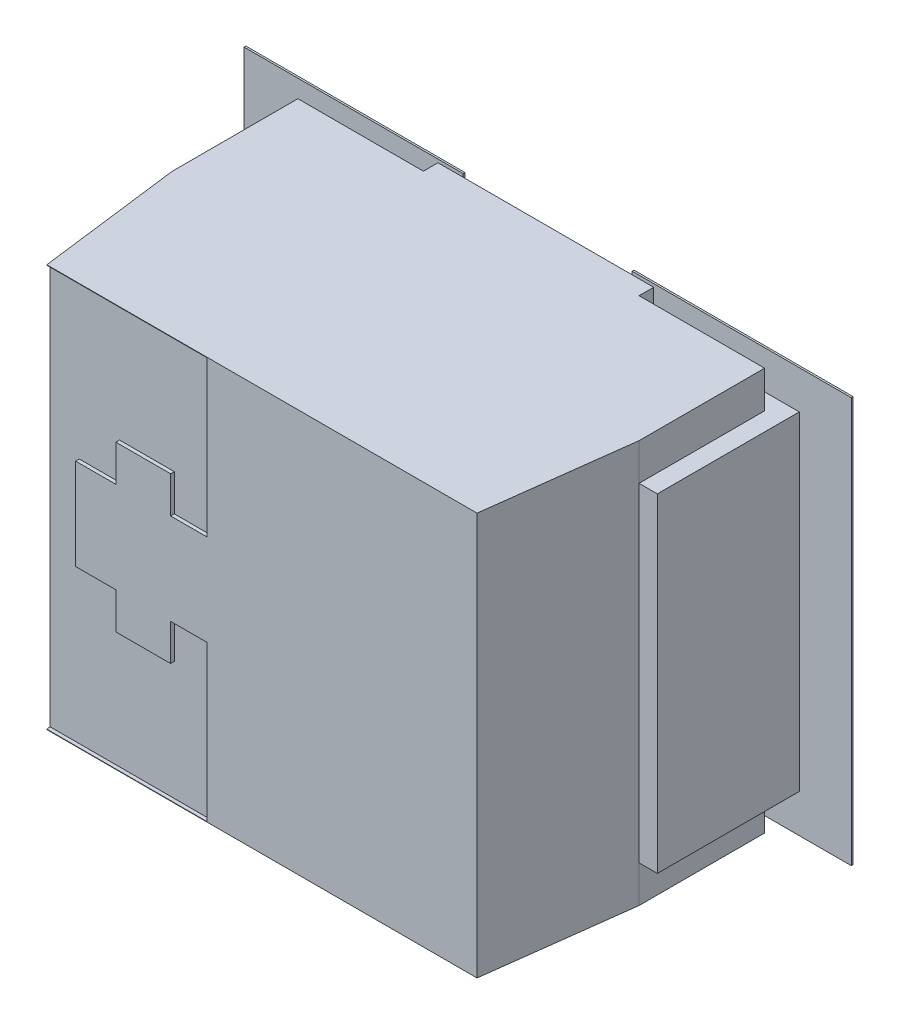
ISO-10303-21;
HEADER;
FILE_DESCRIPTION(('STEP AP214'),'2;1');
FILE_NAME('part.step','',(''),(''),'','','');
FILE_SCHEMA(('AUTOMOTIVE_DESIGN { 1 0 10303 214 1 1 1 1 }'));
ENDSEC;
DATA;
#1=APPLICATION_CONTEXT('core data for automotive mechanical design processes');
#2=APPLICATION_PROTOCOL_DEFINITION('international standard','automotive_design',2000,#1);
#3=PRODUCT_CONTEXT('',#1,'mechanical');
#4=PRODUCT('Part','Part','',(#3));
#5=PRODUCT_RELATED_PRODUCT_CATEGORY('part','',(#4));
#6=PRODUCT_DEFINITION_FORMATION('','',#4);
#7=PRODUCT_DEFINITION_CONTEXT('part definition',#1,'design');
#8=PRODUCT_DEFINITION('design','',#6,#7);
#9=PRODUCT_DEFINITION_SHAPE('','',#8);
#10=(LENGTH_UNIT() NAMED_UNIT(*) SI_UNIT(.MILLI.,.METRE.));
#11=(NAMED_UNIT(*) PLANE_ANGLE_UNIT() SI_UNIT($,.RADIAN.));
#12=(NAMED_UNIT(*) SI_UNIT($,.STERADIAN.) SOLID_ANGLE_UNIT());
#13=UNCERTAINTY_MEASURE_WITH_UNIT(LENGTH_MEASURE(1.E-05),#10,'distance_accuracy_value','');
#14=(GEOMETRIC_REPRESENTATION_CONTEXT(3) GLOBAL_UNCERTAINTY_ASSIGNED_CONTEXT((#13)) GLOBAL_UNIT_ASSIGNED_CONTEXT((#10,
#11,#12)) REPRESENTATION_CONTEXT('',''));
#15=CARTESIAN_POINT('',(0.,0.,0.));
#16=DIRECTION('',(0.,0.,1.));
#17=DIRECTION('',(1.,0.,0.));
#18=AXIS2_PLACEMENT_3D('',#15,#16,#17);
#19=CARTESIAN_POINT('',(0.,0.,2.050796));
#20=DIRECTION('',(0.,0.,1.));
#21=DIRECTION('',(1.,0.,0.));
#22=AXIS2_PLACEMENT_3D('',#19,#20,#21);
#23=PLANE('',#22);
#24=DIRECTION('',(0.,1.,0.));
#25=VECTOR('',#24,1.);
#26=CARTESIAN_POINT('',(-1.49922580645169,-1.39999999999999,2.050796));
#27=LINE('',#26,#25);
#28=CARTESIAN_POINT('',(-1.49922580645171,1.397,2.050796));
#29=VERTEX_POINT('',#28);
#30=CARTESIAN_POINT('',(-1.49922580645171,-1.397,2.050796));
#31=VERTEX_POINT('',#30);
#32=EDGE_CURVE('E332',#29,#31,#27,.F.);
#33=ORIENTED_EDGE('',*,*,#32,.T.);
#34=DIRECTION('',(1.,0.,0.));
#35=VECTOR('',#34,1.);
#36=CARTESIAN_POINT('',(0.,-1.397,2.050796));
#37=LINE('',#36,#35);
#38=CARTESIAN_POINT('',(-0.381,-1.397,2.050796));
#39=VERTEX_POINT('',#38);
#40=EDGE_CURVE('E330',#31,#39,#37,.T.);
#41=ORIENTED_EDGE('',*,*,#40,.T.);
#42=DIRECTION('',(0.,1.,0.));
#43=VECTOR('',#42,1.);
#44=CARTESIAN_POINT('',(-0.381,0.,2.050796));
#45=LINE('',#44,#43);
#46=CARTESIAN_POINT('',(-0.381,-0.3175,2.050796));
#47=VERTEX_POINT('',#46);
#48=EDGE_CURVE('E19',#39,#47,#45,.T.);
#49=ORIENTED_EDGE('',*,*,#48,.T.);
#50=DIRECTION('',(1.,0.,0.));
#51=VECTOR('',#50,1.);
#52=CARTESIAN_POINT('',(0.,-0.3175,2.050796));
#53=LINE('',#52,#51);
#54=CARTESIAN_POINT('',(-0.635,-0.3175,2.050796));
#55=VERTEX_POINT('',#54);
#56=EDGE_CURVE('E312',#47,#55,#53,.F.);
#57=ORIENTED_EDGE('',*,*,#56,.T.);
#58=DIRECTION('',(0.,1.,0.));
#59=VECTOR('',#58,1.);
#60=CARTESIAN_POINT('',(-0.635,0.,2.050796));
#61=LINE('',#60,#59);
#62=CARTESIAN_POINT('',(-0.635,-0.5715,2.050796));
#63=VERTEX_POINT('',#62);
#64=EDGE_CURVE('E320',#55,#63,#61,.F.);
#65=ORIENTED_EDGE('',*,*,#64,.T.);
#66=DIRECTION('',(1.,0.,0.));
#67=VECTOR('',#66,1.);
#68=CARTESIAN_POINT('',(0.,-0.5715,2.050796));
#69=LINE('',#68,#67);
#70=CARTESIAN_POINT('',(-1.016,-0.5715,2.050796));
#71=VERTEX_POINT('',#70);
#72=EDGE_CURVE('E369',#63,#71,#69,.F.);
#73=ORIENTED_EDGE('',*,*,#72,.T.);
#74=DIRECTION('',(0.,1.,0.));
#75=VECTOR('',#74,1.);
#76=CARTESIAN_POINT('',(-1.016,0.,2.050796));
#77=LINE('',#76,#75);
#78=CARTESIAN_POINT('',(-1.016,-0.3175,2.050796));
#79=VERTEX_POINT('',#78);
#80=EDGE_CURVE('E366',#71,#79,#77,.T.);
#81=ORIENTED_EDGE('',*,*,#80,.T.);
#82=DIRECTION('',(1.,0.,0.));
#83=VECTOR('',#82,1.);
#84=CARTESIAN_POINT('',(0.,-0.3175,2.050796));
#85=LINE('',#84,#83);
#86=CARTESIAN_POINT('',(-1.2954,-0.3175,2.050796));
#87=VERTEX_POINT('',#86);
#88=EDGE_CURVE('E363',#79,#87,#85,.F.);
#89=ORIENTED_EDGE('',*,*,#88,.T.);
#90=DIRECTION('',(0.,1.,0.));
#91=VECTOR('',#90,1.);
#92=CARTESIAN_POINT('',(-1.2954,0.,2.050796));
#93=LINE('',#92,#91);
#94=CARTESIAN_POINT('',(-1.2954,0.3175,2.050796));
#95=VERTEX_POINT('',#94);
#96=EDGE_CURVE('E360',#87,#95,#93,.T.);
#97=ORIENTED_EDGE('',*,*,#96,.T.);
#98=DIRECTION('',(1.,0.,0.));
#99=VECTOR('',#98,1.);
#100=CARTESIAN_POINT('',(0.,0.3175,2.050796));
#101=LINE('',#100,#99);
#102=CARTESIAN_POINT('',(-1.016,0.3175,2.050796));
#103=VERTEX_POINT('',#102);
#104=EDGE_CURVE('E357',#95,#103,#101,.T.);
#105=ORIENTED_EDGE('',*,*,#104,.T.);
#106=DIRECTION('',(0.,1.,0.));
#107=VECTOR('',#106,1.);
#108=CARTESIAN_POINT('',(-1.016,0.,2.050796));
#109=LINE('',#108,#107);
#110=CARTESIAN_POINT('',(-1.016,0.5715,2.050796));
#111=VERTEX_POINT('',#110);
#112=EDGE_CURVE('E354',#103,#111,#109,.T.);
#113=ORIENTED_EDGE('',*,*,#112,.T.);
#114=DIRECTION('',(1.,0.,0.));
#115=VECTOR('',#114,1.);
#116=CARTESIAN_POINT('',(0.,0.5715,2.050796));
#117=LINE('',#116,#115);
#118=CARTESIAN_POINT('',(-0.635,0.5715,2.050796));
#119=VERTEX_POINT('',#118);
#120=EDGE_CURVE('E351',#111,#119,#117,.T.);
#121=ORIENTED_EDGE('',*,*,#120,.T.);
#122=DIRECTION('',(0.,1.,0.));
#123=VECTOR('',#122,1.);
#124=CARTESIAN_POINT('',(-0.635,0.,2.050796));
#125=LINE('',#124,#123);
#126=CARTESIAN_POINT('',(-0.635,0.3175,2.050796));
#127=VERTEX_POINT('',#126);
#128=EDGE_CURVE('E348',#119,#127,#125,.F.);
#129=ORIENTED_EDGE('',*,*,#128,.T.);
#130=DIRECTION('',(1.,0.,0.));
#131=VECTOR('',#130,1.);
#132=CARTESIAN_POINT('',(0.,0.3175,2.050796));
#133=LINE('',#132,#131);
#134=CARTESIAN_POINT('',(-0.381,0.3175,2.050796));
#135=VERTEX_POINT('',#134);
#136=EDGE_CURVE('E345',#127,#135,#133,.T.);
#137=ORIENTED_EDGE('',*,*,#136,.T.);
#138=DIRECTION('',(0.,1.,0.));
#139=VECTOR('',#138,1.);
#140=CARTESIAN_POINT('',(-0.381,0.,2.050796));
#141=LINE('',#140,#139);
#142=CARTESIAN_POINT('',(-0.381,1.397,2.050796));
#143=VERTEX_POINT('',#142);
#144=EDGE_CURVE('E339',#135,#143,#141,.T.);
#145=ORIENTED_EDGE('',*,*,#144,.T.);
#146=DIRECTION('',(1.,0.,0.));
#147=VECTOR('',#146,1.);
#148=CARTESIAN_POINT('',(0.,1.397,2.050796));
#149=LINE('',#148,#147);
#150=EDGE_CURVE('E335',#143,#29,#149,.F.);
#151=ORIENTED_EDGE('',*,*,#150,.T.);
#152=EDGE_LOOP('',(#33,#41,#49,#57,#65,#73,#81,#89,#97,#105,#113,#121,#129,#137,#145,#151));
#153=FACE_BOUND('',#152,.T.);
#154=ADVANCED_FACE('F16',(#153),#23,.T.);
#155=CARTESIAN_POINT('',(-1.62300000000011,-1.39999999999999,1.076198));
#156=DIRECTION('',(0.992031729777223,0.,-0.125988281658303));
#157=DIRECTION('',(-0.125988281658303,0.,-0.992031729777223));
#158=AXIS2_PLACEMENT_3D('',#155,#156,#157);
#159=PLANE('',#158);
#160=DIRECTION('',(0.,1.,0.));
#161=VECTOR('',#160,1.);
#162=CARTESIAN_POINT('',(-1.49600000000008,-1.39999999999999,2.076196));
#163=LINE('',#162,#161);
#164=CARTESIAN_POINT('',(-1.4960000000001,1.39999999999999,2.076196));
#165=VERTEX_POINT('',#164);
#166=CARTESIAN_POINT('',(-1.4960000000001,1.397,2.076196));
#167=VERTEX_POINT('',#166);
#168=EDGE_CURVE('E616',#165,#167,#163,.F.);
#169=ORIENTED_EDGE('',*,*,#168,.F.);
#170=DIRECTION('',(-0.125988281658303,0.,-0.992031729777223));
#171=VECTOR('',#170,1.);
#172=CARTESIAN_POINT('',(-1.62300000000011,1.39999999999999,1.076198));
#173=LINE('',#172,#171);
#174=CARTESIAN_POINT('',(-1.62300000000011,1.39999999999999,1.076198));
#175=VERTEX_POINT('',#174);
#176=EDGE_CURVE('E618',#175,#165,#173,.F.);
#177=ORIENTED_EDGE('',*,*,#176,.F.);
#178=DIRECTION('',(0.,1.,0.));
#179=VECTOR('',#178,1.);
#180=CARTESIAN_POINT('',(-1.62300000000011,-1.39999999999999,1.076198));
#181=LINE('',#180,#179);
#182=CARTESIAN_POINT('',(-1.62300000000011,1.143,1.076198));
#183=VERTEX_POINT('',#182);
#184=EDGE_CURVE('E620',#183,#175,#181,.T.);
#185=ORIENTED_EDGE('',*,*,#184,.F.);
#186=DIRECTION('',(0.,1.,0.));
#187=VECTOR('',#186,1.);
#188=CARTESIAN_POINT('',(-1.62300000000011,-1.143,1.076198));
#189=LINE('',#188,#187);
#190=CARTESIAN_POINT('',(-1.62300000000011,-1.143,1.076198));
#191=VERTEX_POINT('',#190);
#192=EDGE_CURVE('E605',#191,#183,#189,.T.);
#193=ORIENTED_EDGE('',*,*,#192,.F.);
#194=DIRECTION('',(0.,1.,0.));
#195=VECTOR('',#194,1.);
#196=CARTESIAN_POINT('',(-1.62300000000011,-1.39999999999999,1.076198));
#197=LINE('',#196,#195);
#198=CARTESIAN_POINT('',(-1.62300000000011,-1.39999999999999,1.076198));
#199=VERTEX_POINT('',#198);
#200=EDGE_CURVE('E622',#199,#191,#197,.T.);
#201=ORIENTED_EDGE('',*,*,#200,.F.);
#202=DIRECTION('',(-0.125988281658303,0.,-0.992031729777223));
#203=VECTOR('',#202,1.);
#204=CARTESIAN_POINT('',(-1.62300000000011,-1.39999999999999,1.076198));
#205=LINE('',#204,#203);
#206=CARTESIAN_POINT('',(-1.4960000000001,-1.39999999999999,2.076196));
#207=VERTEX_POINT('',#206);
#208=EDGE_CURVE('E624',#207,#199,#205,.T.);
#209=ORIENTED_EDGE('',*,*,#208,.F.);
#210=DIRECTION('',(0.,1.,0.));
#211=VECTOR('',#210,1.);
#212=CARTESIAN_POINT('',(-1.49600000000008,-1.39999999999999,2.076196));
#213=LINE('',#212,#211);
#214=CARTESIAN_POINT('',(-1.4960000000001,-1.397,2.076196));
#215=VERTEX_POINT('',#214);
#216=EDGE_CURVE('E626',#215,#207,#213,.F.);
#217=ORIENTED_EDGE('',*,*,#216,.F.);
#218=DIRECTION('',(-0.125988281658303,0.,-0.992031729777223));
#219=VECTOR('',#218,1.);
#220=CARTESIAN_POINT('',(-1.62300000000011,-1.397,1.076198));
#221=LINE('',#220,#219);
#222=EDGE_CURVE('E337',#31,#215,#221,.F.);
#223=ORIENTED_EDGE('',*,*,#222,.F.);
#224=ORIENTED_EDGE('',*,*,#32,.F.);
#225=DIRECTION('',(-0.125988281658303,0.,-0.992031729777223));
#226=VECTOR('',#225,1.);
#227=CARTESIAN_POINT('',(-1.62300000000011,1.397,1.076198));
#228=LINE('',#227,#226);
#229=EDGE_CURVE('E613',#167,#29,#228,.T.);
#230=ORIENTED_EDGE('',*,*,#229,.F.);
#231=EDGE_LOOP('',(#169,#177,#185,#193,#201,#209,#217,#223,#224,#230));
#232=FACE_BOUND('',#231,.T.);
#233=ADVANCED_FACE('F640',(#232),#159,.F.);
#234=CARTESIAN_POINT('',(-0.95000000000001,-1.143,0.0762));
#235=DIRECTION('',(0.,0.,-1.));
#236=DIRECTION('',(-1.,0.,0.));
#237=AXIS2_PLACEMENT_3D('',#234,#235,#236);
#238=PLANE('',#237);
#239=DIRECTION('',(1.,0.,0.));
#240=VECTOR('',#239,1.);
#241=CARTESIAN_POINT('',(-2.11201,-1.4094968,0.0762));
#242=LINE('',#241,#240);
#243=CARTESIAN_POINT('',(-2.11201,-1.4094968,0.0762));
#244=VERTEX_POINT('',#243);
#245=CARTESIAN_POINT('',(-0.58801,-1.4094968,0.0762));
#246=VERTEX_POINT('',#245);
#247=EDGE_CURVE('E603',#244,#246,#242,.T.);
#248=ORIENTED_EDGE('',*,*,#247,.F.);
#249=DIRECTION('',(0.,1.,0.));
#250=VECTOR('',#249,1.);
#251=CARTESIAN_POINT('',(-2.11201,1.4094968,0.0762));
#252=LINE('',#251,#250);
#253=CARTESIAN_POINT('',(-2.11201,1.4094968,0.0762));
#254=VERTEX_POINT('',#253);
#255=EDGE_CURVE('E584',#254,#244,#252,.F.);
#256=ORIENTED_EDGE('',*,*,#255,.F.);
#257=DIRECTION('',(1.,0.,0.));
#258=VECTOR('',#257,1.);
#259=CARTESIAN_POINT('',(-0.58801,1.4094968,0.0762));
#260=LINE('',#259,#258);
#261=CARTESIAN_POINT('',(-0.58801,1.4094968,0.0762));
#262=VERTEX_POINT('',#261);
#263=EDGE_CURVE('E593',#262,#254,#260,.F.);
#264=ORIENTED_EDGE('',*,*,#263,.F.);
#265=DIRECTION('',(0.,1.,0.));
#266=VECTOR('',#265,1.);
#267=CARTESIAN_POINT('',(-0.58801,-1.4094968,0.0762));
#268=LINE('',#267,#266);
#269=EDGE_CURVE('E598',#246,#262,#268,.T.);
#270=ORIENTED_EDGE('',*,*,#269,.F.);
#271=EDGE_LOOP('',(#248,#256,#264,#270));
#272=FACE_BOUND('',#271,.T.);
#273=ADVANCED_FACE('F1043',(#272),#238,.T.);
#274=CARTESIAN_POINT('',(-1.75000000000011,-1.143,1.076198));
#275=DIRECTION('',(0.,0.,1.));
#276=DIRECTION('',(1.,0.,0.));
#277=AXIS2_PLACEMENT_3D('',#274,#275,#276);
#278=PLANE('',#277);
#279=DIRECTION('',(1.,0.,0.));
#280=VECTOR('',#279,1.);
#281=CARTESIAN_POINT('',(-1.75000000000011,-1.143,1.076198));
#282=LINE('',#281,#280);
#283=CARTESIAN_POINT('',(-1.75000000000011,-1.143,1.076198));
#284=VERTEX_POINT('',#283);
#285=EDGE_CURVE('E608',#284,#191,#282,.T.);
#286=ORIENTED_EDGE('',*,*,#285,.T.);
#287=ORIENTED_EDGE('',*,*,#192,.T.);
#288=DIRECTION('',(1.,0.,0.));
#289=VECTOR('',#288,1.);
#290=CARTESIAN_POINT('',(-1.75000000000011,1.143,1.076198));
#291=LINE('',#290,#289);
#292=CARTESIAN_POINT('',(-1.75000000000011,1.143,1.076198));
#293=VERTEX_POINT('',#292);
#294=EDGE_CURVE('E611',#183,#293,#291,.F.);
#295=ORIENTED_EDGE('',*,*,#294,.T.);
#296=DIRECTION('',(0.,1.,0.));
#297=VECTOR('',#296,1.);
#298=CARTESIAN_POINT('',(-1.75000000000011,-1.143,1.076198));
#299=LINE('',#298,#297);
#300=EDGE_CURVE('E578',#284,#293,#299,.T.);
#301=ORIENTED_EDGE('',*,*,#300,.F.);
#302=EDGE_LOOP('',(#286,#287,#295,#301));
#303=FACE_BOUND('',#302,.T.);
#304=ADVANCED_FACE('F718',(#303),#278,.T.);
#305=CARTESIAN_POINT('',(-2.11201,-1.4094968,0.0762));
#306=DIRECTION('',(0.,-1.,0.));
#307=DIRECTION('',(0.,0.,-1.));
#308=AXIS2_PLACEMENT_3D('',#305,#306,#307);
#309=PLANE('',#308);
#310=DIRECTION('',(0.,0.,1.));
#311=VECTOR('',#310,1.);
#312=CARTESIAN_POINT('',(-2.11201,-1.4094968,0.0762));
#313=LINE('',#312,#311);
#314=CARTESIAN_POINT('',(-2.11201,-1.4094968,0.0889));
#315=VERTEX_POINT('',#314);
#316=EDGE_CURVE('E590',#244,#315,#313,.T.);
#317=ORIENTED_EDGE('',*,*,#316,.F.);
#318=ORIENTED_EDGE('',*,*,#247,.T.);
#319=DIRECTION('',(0.,0.,-1.));
#320=VECTOR('',#319,1.);
#321=CARTESIAN_POINT('',(-0.58801,-1.4094968,0.0762));
#322=LINE('',#321,#320);
#323=CARTESIAN_POINT('',(-0.58801,-1.4094968,0.0889));
#324=VERTEX_POINT('',#323);
#325=EDGE_CURVE('E600',#324,#246,#322,.T.);
#326=ORIENTED_EDGE('',*,*,#325,.F.);
#327=DIRECTION('',(1.,0.,0.));
#328=VECTOR('',#327,1.);
#329=CARTESIAN_POINT('',(0.,-1.4094968,0.0889));
#330=LINE('',#329,#328);
#331=EDGE_CURVE('E573',#315,#324,#330,.T.);
#332=ORIENTED_EDGE('',*,*,#331,.F.);
#333=EDGE_LOOP('',(#317,#318,#326,#332));
#334=FACE_BOUND('',#333,.T.);
#335=ADVANCED_FACE('F1042',(#334),#309,.T.);
#336=CARTESIAN_POINT('',(-0.58801,-1.4094968,0.0762));
#337=DIRECTION('',(1.,0.,0.));
#338=DIRECTION('',(0.,0.,-1.));
#339=AXIS2_PLACEMENT_3D('',#336,#337,#338);
#340=PLANE('',#339);
#341=ORIENTED_EDGE('',*,*,#325,.T.);
#342=ORIENTED_EDGE('',*,*,#269,.T.);
#343=DIRECTION('',(0.,0.,1.));
#344=VECTOR('',#343,1.);
#345=CARTESIAN_POINT('',(-0.58801,1.4094968,0.0762));
#346=LINE('',#345,#344);
#347=CARTESIAN_POINT('',(-0.58801,1.4094968,0.0889));
#348=VERTEX_POINT('',#347);
#349=EDGE_CURVE('E595',#348,#262,#346,.F.);
#350=ORIENTED_EDGE('',*,*,#349,.F.);
#351=DIRECTION('',(0.,1.,0.));
#352=VECTOR('',#351,1.);
#353=CARTESIAN_POINT('',(-0.58801,0.,0.0889));
#354=LINE('',#353,#352);
#355=EDGE_CURVE('E570',#324,#348,#354,.T.);
#356=ORIENTED_EDGE('',*,*,#355,.F.);
#357=EDGE_LOOP('',(#341,#342,#350,#356));
#358=FACE_BOUND('',#357,.T.);
#359=ADVANCED_FACE('F1105',(#358),#340,.T.);
#360=CARTESIAN_POINT('',(-0.58801,1.4094968,0.0762));
#361=DIRECTION('',(0.,1.,0.));
#362=DIRECTION('',(0.,0.,1.));
#363=AXIS2_PLACEMENT_3D('',#360,#361,#362);
#364=PLANE('',#363);
#365=ORIENTED_EDGE('',*,*,#349,.T.);
#366=ORIENTED_EDGE('',*,*,#263,.T.);
#367=DIRECTION('',(0.,0.,1.));
#368=VECTOR('',#367,1.);
#369=CARTESIAN_POINT('',(-2.11201,1.4094968,0.0762));
#370=LINE('',#369,#368);
#371=CARTESIAN_POINT('',(-2.11201,1.4094968,0.0889));
#372=VERTEX_POINT('',#371);
#373=EDGE_CURVE('E587',#372,#254,#370,.F.);
#374=ORIENTED_EDGE('',*,*,#373,.F.);
#375=DIRECTION('',(1.,0.,0.));
#376=VECTOR('',#375,1.);
#377=CARTESIAN_POINT('',(0.,1.4094968,0.0889));
#378=LINE('',#377,#376);
#379=EDGE_CURVE('E567',#348,#372,#378,.F.);
#380=ORIENTED_EDGE('',*,*,#379,.F.);
#381=EDGE_LOOP('',(#365,#366,#374,#380));
#382=FACE_BOUND('',#381,.T.);
#383=ADVANCED_FACE('F1112',(#382),#364,.T.);
#384=CARTESIAN_POINT('',(-2.11201,1.4094968,0.0762));
#385=DIRECTION('',(-1.,0.,0.));
#386=DIRECTION('',(0.,0.,1.));
#387=AXIS2_PLACEMENT_3D('',#384,#385,#386);
#388=PLANE('',#387);
#389=ORIENTED_EDGE('',*,*,#373,.T.);
#390=ORIENTED_EDGE('',*,*,#255,.T.);
#391=ORIENTED_EDGE('',*,*,#316,.T.);
#392=DIRECTION('',(0.,1.,0.));
#393=VECTOR('',#392,1.);
#394=CARTESIAN_POINT('',(-2.11201,0.,0.0889));
#395=LINE('',#394,#393);
#396=EDGE_CURVE('E564',#372,#315,#395,.F.);
#397=ORIENTED_EDGE('',*,*,#396,.F.);
#398=EDGE_LOOP('',(#389,#390,#391,#397));
#399=FACE_BOUND('',#398,.T.);
#400=ADVANCED_FACE('F1030',(#399),#388,.T.);
#401=CARTESIAN_POINT('',(-1.75000000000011,-1.143,0.0762));
#402=DIRECTION('',(-1.,0.,0.));
#403=DIRECTION('',(0.,0.,1.));
#404=AXIS2_PLACEMENT_3D('',#401,#402,#403);
#405=PLANE('',#404);
#406=DIRECTION('',(0.,0.,1.));
#407=VECTOR('',#406,1.);
#408=CARTESIAN_POINT('',(-1.75000000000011,1.143,0.0762));
#409=LINE('',#408,#407);
#410=CARTESIAN_POINT('',(-1.75000000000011,1.143,0.0889));
#411=VERTEX_POINT('',#410);
#412=EDGE_CURVE('E576',#293,#411,#409,.F.);
#413=ORIENTED_EDGE('',*,*,#412,.T.);
#414=DIRECTION('',(0.,1.,0.));
#415=VECTOR('',#414,1.);
#416=CARTESIAN_POINT('',(-1.75000000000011,0.,0.0889));
#417=LINE('',#416,#415);
#418=CARTESIAN_POINT('',(-1.75000000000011,-1.143,0.0889));
#419=VERTEX_POINT('',#418);
#420=EDGE_CURVE('E561',#419,#411,#417,.T.);
#421=ORIENTED_EDGE('',*,*,#420,.F.);
#422=DIRECTION('',(0.,0.,1.));
#423=VECTOR('',#422,1.);
#424=CARTESIAN_POINT('',(-1.75000000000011,-1.143,0.0762));
#425=LINE('',#424,#423);
#426=EDGE_CURVE('E581',#419,#284,#425,.T.);
#427=ORIENTED_EDGE('',*,*,#426,.T.);
#428=ORIENTED_EDGE('',*,*,#300,.T.);
#429=EDGE_LOOP('',(#413,#421,#427,#428));
#430=FACE_BOUND('',#429,.T.);
#431=ADVANCED_FACE('F715',(#430),#405,.T.);
#432=CARTESIAN_POINT('',(0.,0.,0.0889));
#433=DIRECTION('',(0.,0.,1.));
#434=DIRECTION('',(1.,0.,0.));
#435=AXIS2_PLACEMENT_3D('',#432,#433,#434);
#436=PLANE('',#435);
#437=DIRECTION('',(0.,1.,0.));
#438=VECTOR('',#437,1.);
#439=CARTESIAN_POINT('',(-0.95000000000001,-1.143,0.0889));
#440=LINE('',#439,#438);
#441=CARTESIAN_POINT('',(-0.95000000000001,-1.143,0.0889));
#442=VERTEX_POINT('',#441);
#443=CARTESIAN_POINT('',(-0.95000000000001,1.143,0.0889));
#444=VERTEX_POINT('',#443);
#445=EDGE_CURVE('E546',#442,#444,#440,.T.);
#446=ORIENTED_EDGE('',*,*,#445,.F.);
#447=DIRECTION('',(1.,0.,0.));
#448=VECTOR('',#447,1.);
#449=CARTESIAN_POINT('',(0.,-1.143,0.0889));
#450=LINE('',#449,#448);
#451=EDGE_CURVE('E555',#442,#419,#450,.F.);
#452=ORIENTED_EDGE('',*,*,#451,.T.);
#453=ORIENTED_EDGE('',*,*,#420,.T.);
#454=DIRECTION('',(1.,0.,0.));
#455=VECTOR('',#454,1.);
#456=CARTESIAN_POINT('',(0.,1.143,0.0889));
#457=LINE('',#456,#455);
#458=EDGE_CURVE('E558',#411,#444,#457,.T.);
#459=ORIENTED_EDGE('',*,*,#458,.T.);
#460=EDGE_LOOP('',(#446,#452,#453,#459));
#461=FACE_BOUND('',#460,.T.);
#462=ORIENTED_EDGE('',*,*,#379,.T.);
#463=ORIENTED_EDGE('',*,*,#396,.T.);
#464=ORIENTED_EDGE('',*,*,#331,.T.);
#465=ORIENTED_EDGE('',*,*,#355,.T.);
#466=EDGE_LOOP('',(#462,#463,#464,#465));
#467=FACE_BOUND('',#466,.T.);
#468=ADVANCED_FACE('F711',(#461,#467),#436,.T.);
#469=CARTESIAN_POINT('',(-0.95000000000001,-1.143,0.2032));
#470=DIRECTION('',(1.,0.,0.));
#471=DIRECTION('',(0.,0.,-1.));
#472=AXIS2_PLACEMENT_3D('',#469,#470,#471);
#473=PLANE('',#472);
#474=DIRECTION('',(0.,0.,-1.));
#475=VECTOR('',#474,1.);
#476=CARTESIAN_POINT('',(-0.95000000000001,-1.143,0.2032));
#477=LINE('',#476,#475);
#478=CARTESIAN_POINT('',(-0.95000000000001,-1.143,0.2032));
#479=VERTEX_POINT('',#478);
#480=EDGE_CURVE('E549',#479,#442,#477,.T.);
#481=ORIENTED_EDGE('',*,*,#480,.T.);
#482=ORIENTED_EDGE('',*,*,#445,.T.);
#483=DIRECTION('',(0.,0.,-1.));
#484=VECTOR('',#483,1.);
#485=CARTESIAN_POINT('',(-0.95000000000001,1.143,0.2032));
#486=LINE('',#485,#484);
#487=CARTESIAN_POINT('',(-0.95000000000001,1.143,0.2032));
#488=VERTEX_POINT('',#487);
#489=EDGE_CURVE('E552',#444,#488,#486,.F.);
#490=ORIENTED_EDGE('',*,*,#489,.T.);
#491=DIRECTION('',(0.,1.,0.));
#492=VECTOR('',#491,1.);
#493=CARTESIAN_POINT('',(-0.95000000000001,-1.39999999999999,0.2032));
#494=LINE('',#493,#492);
#495=EDGE_CURVE('E531',#488,#479,#494,.F.);
#496=ORIENTED_EDGE('',*,*,#495,.T.);
#497=EDGE_LOOP('',(#481,#482,#490,#496));
#498=FACE_BOUND('',#497,.T.);
#499=ADVANCED_FACE('F707',(#498),#473,.T.);
#500=CARTESIAN_POINT('',(-0.750000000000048,-1.39999999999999,0.2032));
#501=DIRECTION('',(0.,0.,1.));
#502=DIRECTION('',(1.,0.,0.));
#503=AXIS2_PLACEMENT_3D('',#500,#501,#502);
#504=PLANE('',#503);
#505=DIRECTION('',(1.,0.,0.));
#506=VECTOR('',#505,1.);
#507=CARTESIAN_POINT('',(-0.750000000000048,1.143,0.2032));
#508=LINE('',#507,#506);
#509=CARTESIAN_POINT('',(-1.62300000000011,1.143,0.2032));
#510=VERTEX_POINT('',#509);
#511=EDGE_CURVE('E534',#510,#488,#508,.T.);
#512=ORIENTED_EDGE('',*,*,#511,.F.);
#513=DIRECTION('',(0.,1.,0.));
#514=VECTOR('',#513,1.);
#515=CARTESIAN_POINT('',(-1.62300000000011,-1.39999999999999,0.2032));
#516=LINE('',#515,#514);
#517=CARTESIAN_POINT('',(-1.62300000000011,1.39999999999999,0.2032));
#518=VERTEX_POINT('',#517);
#519=EDGE_CURVE('E536',#518,#510,#516,.F.);
#520=ORIENTED_EDGE('',*,*,#519,.F.);
#521=DIRECTION('',(1.,0.,0.));
#522=VECTOR('',#521,1.);
#523=CARTESIAN_POINT('',(-0.750000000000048,1.39999999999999,0.2032));
#524=LINE('',#523,#522);
#525=CARTESIAN_POINT('',(-0.750000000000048,1.39999999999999,0.2032));
#526=VERTEX_POINT('',#525);
#527=EDGE_CURVE('E538',#526,#518,#524,.F.);
#528=ORIENTED_EDGE('',*,*,#527,.F.);
#529=DIRECTION('',(0.,1.,0.));
#530=VECTOR('',#529,1.);
#531=CARTESIAN_POINT('',(-0.750000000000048,-1.39999999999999,0.2032));
#532=LINE('',#531,#530);
#533=CARTESIAN_POINT('',(-0.750000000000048,-1.39999999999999,0.2032));
#534=VERTEX_POINT('',#533);
#535=EDGE_CURVE('E524',#526,#534,#532,.F.);
#536=ORIENTED_EDGE('',*,*,#535,.T.);
#537=DIRECTION('',(1.,0.,0.));
#538=VECTOR('',#537,1.);
#539=CARTESIAN_POINT('',(-0.750000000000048,-1.39999999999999,0.2032));
#540=LINE('',#539,#538);
#541=CARTESIAN_POINT('',(-1.62300000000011,-1.39999999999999,0.2032));
#542=VERTEX_POINT('',#541);
#543=EDGE_CURVE('E540',#542,#534,#540,.T.);
#544=ORIENTED_EDGE('',*,*,#543,.F.);
#545=DIRECTION('',(0.,1.,0.));
#546=VECTOR('',#545,1.);
#547=CARTESIAN_POINT('',(-1.62300000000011,-1.39999999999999,0.2032));
#548=LINE('',#547,#546);
#549=CARTESIAN_POINT('',(-1.62300000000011,-1.143,0.2032));
#550=VERTEX_POINT('',#549);
#551=EDGE_CURVE('E542',#550,#542,#548,.F.);
#552=ORIENTED_EDGE('',*,*,#551,.F.);
#553=DIRECTION('',(1.,0.,0.));
#554=VECTOR('',#553,1.);
#555=CARTESIAN_POINT('',(-0.750000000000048,-1.143,0.2032));
#556=LINE('',#555,#554);
#557=EDGE_CURVE('E544',#479,#550,#556,.F.);
#558=ORIENTED_EDGE('',*,*,#557,.F.);
#559=ORIENTED_EDGE('',*,*,#495,.F.);
#560=EDGE_LOOP('',(#512,#520,#528,#536,#544,#552,#558,#559));
#561=FACE_BOUND('',#560,.T.);
#562=ADVANCED_FACE('F654',(#561),#504,.F.);
#563=CARTESIAN_POINT('',(-0.750000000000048,-1.39999999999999,0.1016));
#564=DIRECTION('',(1.,0.,0.));
#565=DIRECTION('',(0.,0.,-1.));
#566=AXIS2_PLACEMENT_3D('',#563,#564,#565);
#567=PLANE('',#566);
#568=DIRECTION('',(0.,0.,-1.));
#569=VECTOR('',#568,1.);
#570=CARTESIAN_POINT('',(-0.750000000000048,1.39999999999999,0.1016));
#571=LINE('',#570,#569);
#572=CARTESIAN_POINT('',(-0.750000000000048,1.39999999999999,0.1016));
#573=VERTEX_POINT('',#572);
#574=EDGE_CURVE('E527',#573,#526,#571,.F.);
#575=ORIENTED_EDGE('',*,*,#574,.F.);
#576=DIRECTION('',(0.,1.,0.));
#577=VECTOR('',#576,1.);
#578=CARTESIAN_POINT('',(-0.750000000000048,-1.39999999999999,0.1016));
#579=LINE('',#578,#577);
#580=CARTESIAN_POINT('',(-0.750000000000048,-1.39999999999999,0.1016));
#581=VERTEX_POINT('',#580);
#582=EDGE_CURVE('E517',#573,#581,#579,.F.);
#583=ORIENTED_EDGE('',*,*,#582,.T.);
#584=DIRECTION('',(0.,0.,-1.));
#585=VECTOR('',#584,1.);
#586=CARTESIAN_POINT('',(-0.750000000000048,-1.39999999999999,0.1016));
#587=LINE('',#586,#585);
#588=EDGE_CURVE('E529',#534,#581,#587,.T.);
#589=ORIENTED_EDGE('',*,*,#588,.F.);
#590=ORIENTED_EDGE('',*,*,#535,.F.);
#591=EDGE_LOOP('',(#575,#583,#589,#590));
#592=FACE_BOUND('',#591,.T.);
#593=ADVANCED_FACE('F663',(#592),#567,.F.);
#594=CARTESIAN_POINT('',(0.750000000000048,-1.39999999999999,0.1016));
#595=DIRECTION('',(0.,0.,1.));
#596=DIRECTION('',(1.,0.,0.));
#597=AXIS2_PLACEMENT_3D('',#594,#595,#596);
#598=PLANE('',#597);
#599=DIRECTION('',(1.,0.,0.));
#600=VECTOR('',#599,1.);
#601=CARTESIAN_POINT('',(0.750000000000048,1.39999999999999,0.1016));
#602=LINE('',#601,#600);
#603=CARTESIAN_POINT('',(0.750000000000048,1.39999999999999,0.1016));
#604=VERTEX_POINT('',#603);
#605=EDGE_CURVE('E520',#604,#573,#602,.F.);
#606=ORIENTED_EDGE('',*,*,#605,.F.);
#607=DIRECTION('',(0.,1.,0.));
#608=VECTOR('',#607,1.);
#609=CARTESIAN_POINT('',(0.750000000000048,-1.39999999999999,0.1016));
#610=LINE('',#609,#608);
#611=CARTESIAN_POINT('',(0.750000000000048,-1.39999999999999,0.1016));
#612=VERTEX_POINT('',#611);
#613=EDGE_CURVE('E510',#604,#612,#610,.F.);
#614=ORIENTED_EDGE('',*,*,#613,.T.);
#615=DIRECTION('',(1.,0.,0.));
#616=VECTOR('',#615,1.);
#617=CARTESIAN_POINT('',(0.750000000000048,-1.39999999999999,0.1016));
#618=LINE('',#617,#616);
#619=EDGE_CURVE('E522',#581,#612,#618,.T.);
#620=ORIENTED_EDGE('',*,*,#619,.F.);
#621=ORIENTED_EDGE('',*,*,#582,.F.);
#622=EDGE_LOOP('',(#606,#614,#620,#621));
#623=FACE_BOUND('',#622,.T.);
#624=ADVANCED_FACE('F666',(#623),#598,.F.);
#625=CARTESIAN_POINT('',(0.750000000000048,-1.39999999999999,0.2032));
#626=DIRECTION('',(-1.,0.,0.));
#627=DIRECTION('',(0.,0.,1.));
#628=AXIS2_PLACEMENT_3D('',#625,#626,#627);
#629=PLANE('',#628);
#630=DIRECTION('',(0.,0.,1.));
#631=VECTOR('',#630,1.);
#632=CARTESIAN_POINT('',(0.750000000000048,1.39999999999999,0.2032));
#633=LINE('',#632,#631);
#634=CARTESIAN_POINT('',(0.750000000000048,1.39999999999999,0.2032));
#635=VERTEX_POINT('',#634);
#636=EDGE_CURVE('E513',#635,#604,#633,.F.);
#637=ORIENTED_EDGE('',*,*,#636,.F.);
#638=DIRECTION('',(0.,1.,0.));
#639=VECTOR('',#638,1.);
#640=CARTESIAN_POINT('',(0.750000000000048,-1.39999999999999,0.2032));
#641=LINE('',#640,#639);
#642=CARTESIAN_POINT('',(0.750000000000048,-1.39999999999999,0.2032));
#643=VERTEX_POINT('',#642);
#644=EDGE_CURVE('E499',#635,#643,#641,.F.);
#645=ORIENTED_EDGE('',*,*,#644,.T.);
#646=DIRECTION('',(0.,0.,1.));
#647=VECTOR('',#646,1.);
#648=CARTESIAN_POINT('',(0.750000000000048,-1.39999999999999,0.2032));
#649=LINE('',#648,#647);
#650=EDGE_CURVE('E515',#612,#643,#649,.T.);
#651=ORIENTED_EDGE('',*,*,#650,.F.);
#652=ORIENTED_EDGE('',*,*,#613,.F.);
#653=EDGE_LOOP('',(#637,#645,#651,#652));
#654=FACE_BOUND('',#653,.T.);
#655=ADVANCED_FACE('F671',(#654),#629,.F.);
#656=CARTESIAN_POINT('',(-0.95000000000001,-1.143,0.0762));
#657=DIRECTION('',(0.,0.,-1.));
#658=DIRECTION('',(-1.,0.,0.));
#659=AXIS2_PLACEMENT_3D('',#656,#657,#658);
#660=PLANE('',#659);
#661=DIRECTION('',(1.,0.,0.));
#662=VECTOR('',#661,1.);
#663=CARTESIAN_POINT('',(2.11201,1.4094968,0.0762));
#664=LINE('',#663,#662);
#665=CARTESIAN_POINT('',(2.11201,1.4094968,0.0762));
#666=VERTEX_POINT('',#665);
#667=CARTESIAN_POINT('',(0.58801,1.4094968,0.0762));
#668=VERTEX_POINT('',#667);
#669=EDGE_CURVE('E493',#666,#668,#664,.F.);
#670=ORIENTED_EDGE('',*,*,#669,.F.);
#671=DIRECTION('',(0.,1.,0.));
#672=VECTOR('',#671,1.);
#673=CARTESIAN_POINT('',(2.11201,-1.4094968,0.0762));
#674=LINE('',#673,#672);
#675=CARTESIAN_POINT('',(2.11201,-1.4094968,0.0762));
#676=VERTEX_POINT('',#675);
#677=EDGE_CURVE('E474',#676,#666,#674,.T.);
#678=ORIENTED_EDGE('',*,*,#677,.F.);
#679=DIRECTION('',(1.,0.,0.));
#680=VECTOR('',#679,1.);
#681=CARTESIAN_POINT('',(0.58801,-1.4094968,0.0762));
#682=LINE('',#681,#680);
#683=CARTESIAN_POINT('',(0.58801,-1.4094968,0.0762));
#684=VERTEX_POINT('',#683);
#685=EDGE_CURVE('E483',#684,#676,#682,.T.);
#686=ORIENTED_EDGE('',*,*,#685,.F.);
#687=DIRECTION('',(0.,1.,0.));
#688=VECTOR('',#687,1.);
#689=CARTESIAN_POINT('',(0.58801,1.4094968,0.0762));
#690=LINE('',#689,#688);
#691=EDGE_CURVE('E488',#668,#684,#690,.F.);
#692=ORIENTED_EDGE('',*,*,#691,.F.);
#693=EDGE_LOOP('',(#670,#678,#686,#692));
#694=FACE_BOUND('',#693,.T.);
#695=ADVANCED_FACE('F984',(#694),#660,.T.);
#696=CARTESIAN_POINT('',(1.75000000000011,-1.39999999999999,0.2032));
#697=DIRECTION('',(0.,0.,1.));
#698=DIRECTION('',(1.,0.,0.));
#699=AXIS2_PLACEMENT_3D('',#696,#697,#698);
#700=PLANE('',#699);
#701=DIRECTION('',(1.,0.,0.));
#702=VECTOR('',#701,1.);
#703=CARTESIAN_POINT('',(1.75000000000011,-1.39999999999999,0.2032));
#704=LINE('',#703,#702);
#705=CARTESIAN_POINT('',(1.62300000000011,-1.39999999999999,0.2032));
#706=VERTEX_POINT('',#705);
#707=EDGE_CURVE('E497',#643,#706,#704,.T.);
#708=ORIENTED_EDGE('',*,*,#707,.F.);
#709=ORIENTED_EDGE('',*,*,#644,.F.);
#710=DIRECTION('',(1.,0.,0.));
#711=VECTOR('',#710,1.);
#712=CARTESIAN_POINT('',(1.75000000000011,1.39999999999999,0.2032));
#713=LINE('',#712,#711);
#714=CARTESIAN_POINT('',(1.62300000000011,1.39999999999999,0.2032));
#715=VERTEX_POINT('',#714);
#716=EDGE_CURVE('E502',#715,#635,#713,.F.);
#717=ORIENTED_EDGE('',*,*,#716,.F.);
#718=DIRECTION('',(0.,1.,0.));
#719=VECTOR('',#718,1.);
#720=CARTESIAN_POINT('',(1.62300000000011,-1.39999999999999,0.2032));
#721=LINE('',#720,#719);
#722=CARTESIAN_POINT('',(1.62300000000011,1.143,0.2032));
#723=VERTEX_POINT('',#722);
#724=EDGE_CURVE('E504',#723,#715,#721,.T.);
#725=ORIENTED_EDGE('',*,*,#724,.F.);
#726=DIRECTION('',(1.,0.,0.));
#727=VECTOR('',#726,1.);
#728=CARTESIAN_POINT('',(1.75000000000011,1.143,0.2032));
#729=LINE('',#728,#727);
#730=CARTESIAN_POINT('',(0.95000000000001,1.143,0.2032));
#731=VERTEX_POINT('',#730);
#732=EDGE_CURVE('E506',#731,#723,#729,.T.);
#733=ORIENTED_EDGE('',*,*,#732,.F.);
#734=DIRECTION('',(0.,1.,0.));
#735=VECTOR('',#734,1.);
#736=CARTESIAN_POINT('',(0.95000000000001,-1.143,0.2032));
#737=LINE('',#736,#735);
#738=CARTESIAN_POINT('',(0.95000000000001,-1.143,0.2032));
#739=VERTEX_POINT('',#738);
#740=EDGE_CURVE('E468',#739,#731,#737,.T.);
#741=ORIENTED_EDGE('',*,*,#740,.F.);
#742=DIRECTION('',(1.,0.,0.));
#743=VECTOR('',#742,1.);
#744=CARTESIAN_POINT('',(1.75000000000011,-1.143,0.2032));
#745=LINE('',#744,#743);
#746=CARTESIAN_POINT('',(1.62300000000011,-1.143,0.2032));
#747=VERTEX_POINT('',#746);
#748=EDGE_CURVE('E508',#747,#739,#745,.F.);
#749=ORIENTED_EDGE('',*,*,#748,.F.);
#750=DIRECTION('',(0.,1.,0.));
#751=VECTOR('',#750,1.);
#752=CARTESIAN_POINT('',(1.62300000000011,-1.39999999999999,0.2032));
#753=LINE('',#752,#751);
#754=EDGE_CURVE('E495',#706,#747,#753,.T.);
#755=ORIENTED_EDGE('',*,*,#754,.F.);
#756=EDGE_LOOP('',(#708,#709,#717,#725,#733,#741,#749,#755));
#757=FACE_BOUND('',#756,.T.);
#758=ADVANCED_FACE('F683',(#757),#700,.F.);
#759=CARTESIAN_POINT('',(2.11201,1.4094968,0.0762));
#760=DIRECTION('',(0.,1.,0.));
#761=DIRECTION('',(0.,0.,1.));
#762=AXIS2_PLACEMENT_3D('',#759,#760,#761);
#763=PLANE('',#762);
#764=DIRECTION('',(0.,0.,-1.));
#765=VECTOR('',#764,1.);
#766=CARTESIAN_POINT('',(2.11201,1.4094968,0.0762));
#767=LINE('',#766,#765);
#768=CARTESIAN_POINT('',(2.11201,1.4094968,0.0889));
#769=VERTEX_POINT('',#768);
#770=EDGE_CURVE('E480',#666,#769,#767,.F.);
#771=ORIENTED_EDGE('',*,*,#770,.F.);
#772=ORIENTED_EDGE('',*,*,#669,.T.);
#773=DIRECTION('',(0.,0.,1.));
#774=VECTOR('',#773,1.);
#775=CARTESIAN_POINT('',(0.58801,1.4094968,0.0762));
#776=LINE('',#775,#774);
#777=CARTESIAN_POINT('',(0.58801,1.4094968,0.0889));
#778=VERTEX_POINT('',#777);
#779=EDGE_CURVE('E490',#778,#668,#776,.F.);
#780=ORIENTED_EDGE('',*,*,#779,.F.);
#781=DIRECTION('',(1.,0.,0.));
#782=VECTOR('',#781,1.);
#783=CARTESIAN_POINT('',(0.,1.4094968,0.0889));
#784=LINE('',#783,#782);
#785=EDGE_CURVE('E463',#769,#778,#784,.F.);
#786=ORIENTED_EDGE('',*,*,#785,.F.);
#787=EDGE_LOOP('',(#771,#772,#780,#786));
#788=FACE_BOUND('',#787,.T.);
#789=ADVANCED_FACE('F983',(#788),#763,.T.);
#790=CARTESIAN_POINT('',(0.58801,1.4094968,0.0762));
#791=DIRECTION('',(-1.,0.,0.));
#792=DIRECTION('',(0.,0.,1.));
#793=AXIS2_PLACEMENT_3D('',#790,#791,#792);
#794=PLANE('',#793);
#795=ORIENTED_EDGE('',*,*,#779,.T.);
#796=ORIENTED_EDGE('',*,*,#691,.T.);
#797=DIRECTION('',(0.,0.,-1.));
#798=VECTOR('',#797,1.);
#799=CARTESIAN_POINT('',(0.58801,-1.4094968,0.0762));
#800=LINE('',#799,#798);
#801=CARTESIAN_POINT('',(0.58801,-1.4094968,0.0889));
#802=VERTEX_POINT('',#801);
#803=EDGE_CURVE('E485',#802,#684,#800,.T.);
#804=ORIENTED_EDGE('',*,*,#803,.F.);
#805=DIRECTION('',(0.,1.,0.));
#806=VECTOR('',#805,1.);
#807=CARTESIAN_POINT('',(0.58801,0.,0.0889));
#808=LINE('',#807,#806);
#809=EDGE_CURVE('E460',#778,#802,#808,.F.);
#810=ORIENTED_EDGE('',*,*,#809,.F.);
#811=EDGE_LOOP('',(#795,#796,#804,#810));
#812=FACE_BOUND('',#811,.T.);
#813=ADVANCED_FACE('F1154',(#812),#794,.T.);
#814=CARTESIAN_POINT('',(0.58801,-1.4094968,0.0762));
#815=DIRECTION('',(0.,-1.,0.));
#816=DIRECTION('',(0.,0.,-1.));
#817=AXIS2_PLACEMENT_3D('',#814,#815,#816);
#818=PLANE('',#817);
#819=ORIENTED_EDGE('',*,*,#803,.T.);
#820=ORIENTED_EDGE('',*,*,#685,.T.);
#821=DIRECTION('',(0.,0.,-1.));
#822=VECTOR('',#821,1.);
#823=CARTESIAN_POINT('',(2.11201,-1.4094968,0.0762));
#824=LINE('',#823,#822);
#825=CARTESIAN_POINT('',(2.11201,-1.4094968,0.0889));
#826=VERTEX_POINT('',#825);
#827=EDGE_CURVE('E477',#826,#676,#824,.T.);
#828=ORIENTED_EDGE('',*,*,#827,.F.);
#829=DIRECTION('',(1.,0.,0.));
#830=VECTOR('',#829,1.);
#831=CARTESIAN_POINT('',(0.,-1.4094968,0.0889));
#832=LINE('',#831,#830);
#833=EDGE_CURVE('E457',#802,#826,#832,.T.);
#834=ORIENTED_EDGE('',*,*,#833,.F.);
#835=EDGE_LOOP('',(#819,#820,#828,#834));
#836=FACE_BOUND('',#835,.T.);
#837=ADVANCED_FACE('F1161',(#836),#818,.T.);
#838=CARTESIAN_POINT('',(2.11201,-1.4094968,0.0762));
#839=DIRECTION('',(1.,0.,0.));
#840=DIRECTION('',(0.,0.,-1.));
#841=AXIS2_PLACEMENT_3D('',#838,#839,#840);
#842=PLANE('',#841);
#843=ORIENTED_EDGE('',*,*,#827,.T.);
#844=ORIENTED_EDGE('',*,*,#677,.T.);
#845=ORIENTED_EDGE('',*,*,#770,.T.);
#846=DIRECTION('',(0.,1.,0.));
#847=VECTOR('',#846,1.);
#848=CARTESIAN_POINT('',(2.11201,0.,0.0889));
#849=LINE('',#848,#847);
#850=EDGE_CURVE('E454',#826,#769,#849,.T.);
#851=ORIENTED_EDGE('',*,*,#850,.F.);
#852=EDGE_LOOP('',(#843,#844,#845,#851));
#853=FACE_BOUND('',#852,.T.);
#854=ADVANCED_FACE('F1169',(#853),#842,.T.);
#855=CARTESIAN_POINT('',(0.95000000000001,-1.143,0.0762));
#856=DIRECTION('',(-1.,0.,0.));
#857=DIRECTION('',(0.,0.,1.));
#858=AXIS2_PLACEMENT_3D('',#855,#856,#857);
#859=PLANE('',#858);
#860=DIRECTION('',(0.,0.,1.));
#861=VECTOR('',#860,1.);
#862=CARTESIAN_POINT('',(0.95000000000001,1.143,0.0762));
#863=LINE('',#862,#861);
#864=CARTESIAN_POINT('',(0.95000000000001,1.143,0.0889));
#865=VERTEX_POINT('',#864);
#866=EDGE_CURVE('E466',#731,#865,#863,.F.);
#867=ORIENTED_EDGE('',*,*,#866,.T.);
#868=DIRECTION('',(0.,1.,0.));
#869=VECTOR('',#868,1.);
#870=CARTESIAN_POINT('',(0.95000000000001,0.,0.0889));
#871=LINE('',#870,#869);
#872=CARTESIAN_POINT('',(0.95000000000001,-1.143,0.0889));
#873=VERTEX_POINT('',#872);
#874=EDGE_CURVE('E451',#873,#865,#871,.T.);
#875=ORIENTED_EDGE('',*,*,#874,.F.);
#876=DIRECTION('',(0.,0.,1.));
#877=VECTOR('',#876,1.);
#878=CARTESIAN_POINT('',(0.95000000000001,-1.143,0.0762));
#879=LINE('',#878,#877);
#880=EDGE_CURVE('E471',#873,#739,#879,.T.);
#881=ORIENTED_EDGE('',*,*,#880,.T.);
#882=ORIENTED_EDGE('',*,*,#740,.T.);
#883=EDGE_LOOP('',(#867,#875,#881,#882));
#884=FACE_BOUND('',#883,.T.);
#885=ADVANCED_FACE('F970',(#884),#859,.T.);
#886=CARTESIAN_POINT('',(0.,0.,0.0889));
#887=DIRECTION('',(0.,0.,1.));
#888=DIRECTION('',(1.,0.,0.));
#889=AXIS2_PLACEMENT_3D('',#886,#887,#888);
#890=PLANE('',#889);
#891=DIRECTION('',(0.,1.,0.));
#892=VECTOR('',#891,1.);
#893=CARTESIAN_POINT('',(1.75000000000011,-1.143,0.0889));
#894=LINE('',#893,#892);
#895=CARTESIAN_POINT('',(1.75000000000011,-1.143,0.0889));
#896=VERTEX_POINT('',#895);
#897=CARTESIAN_POINT('',(1.75000000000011,1.143,0.0889));
#898=VERTEX_POINT('',#897);
#899=EDGE_CURVE('E440',#896,#898,#894,.T.);
#900=ORIENTED_EDGE('',*,*,#899,.F.);
#901=DIRECTION('',(1.,0.,0.));
#902=VECTOR('',#901,1.);
#903=CARTESIAN_POINT('',(0.,-1.143,0.0889));
#904=LINE('',#903,#902);
#905=EDGE_CURVE('E445',#896,#873,#904,.F.);
#906=ORIENTED_EDGE('',*,*,#905,.T.);
#907=ORIENTED_EDGE('',*,*,#874,.T.);
#908=DIRECTION('',(1.,0.,0.));
#909=VECTOR('',#908,1.);
#910=CARTESIAN_POINT('',(0.,1.143,0.0889));
#911=LINE('',#910,#909);
#912=EDGE_CURVE('E448',#865,#898,#911,.T.);
#913=ORIENTED_EDGE('',*,*,#912,.T.);
#914=EDGE_LOOP('',(#900,#906,#907,#913));
#915=FACE_BOUND('',#914,.T.);
#916=ORIENTED_EDGE('',*,*,#833,.T.);
#917=ORIENTED_EDGE('',*,*,#850,.T.);
#918=ORIENTED_EDGE('',*,*,#785,.T.);
#919=ORIENTED_EDGE('',*,*,#809,.T.);
#920=EDGE_LOOP('',(#916,#917,#918,#919));
#921=FACE_BOUND('',#920,.T.);
#922=ADVANCED_FACE('F959',(#915,#921),#890,.T.);
#923=CARTESIAN_POINT('',(0.,-1.143,0.));
#924=DIRECTION('',(0.,1.,0.));
#925=DIRECTION('',(0.,0.,1.));
#926=AXIS2_PLACEMENT_3D('',#923,#924,#925);
#927=PLANE('',#926);
#928=ORIENTED_EDGE('',*,*,#557,.T.);
#929=DIRECTION('',(0.,0.,-1.));
#930=VECTOR('',#929,1.);
#931=CARTESIAN_POINT('',(-1.62300000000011,-1.143,0.0762));
#932=LINE('',#931,#930);
#933=EDGE_CURVE('E434',#550,#191,#932,.F.);
#934=ORIENTED_EDGE('',*,*,#933,.T.);
#935=ORIENTED_EDGE('',*,*,#285,.F.);
#936=ORIENTED_EDGE('',*,*,#426,.F.);
#937=ORIENTED_EDGE('',*,*,#451,.F.);
#938=ORIENTED_EDGE('',*,*,#480,.F.);
#939=EDGE_LOOP('',(#928,#934,#935,#936,#937,#938));
#940=FACE_BOUND('',#939,.T.);
#941=ADVANCED_FACE('F948',(#940),#927,.F.);
#942=CARTESIAN_POINT('',(1.75000000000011,-1.143,1.076198));
#943=DIRECTION('',(1.,0.,0.));
#944=DIRECTION('',(0.,0.,-1.));
#945=AXIS2_PLACEMENT_3D('',#942,#943,#944);
#946=PLANE('',#945);
#947=DIRECTION('',(0.,0.,1.));
#948=VECTOR('',#947,1.);
#949=CARTESIAN_POINT('',(1.75000000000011,-1.143,0.));
#950=LINE('',#949,#948);
#951=CARTESIAN_POINT('',(1.75000000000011,-1.143,1.076198));
#952=VERTEX_POINT('',#951);
#953=EDGE_CURVE('E437',#952,#896,#950,.F.);
#954=ORIENTED_EDGE('',*,*,#953,.T.);
#955=ORIENTED_EDGE('',*,*,#899,.T.);
#956=DIRECTION('',(0.,0.,-1.));
#957=VECTOR('',#956,1.);
#958=CARTESIAN_POINT('',(1.75000000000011,1.143,1.076198));
#959=LINE('',#958,#957);
#960=CARTESIAN_POINT('',(1.75000000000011,1.143,1.076198));
#961=VERTEX_POINT('',#960);
#962=EDGE_CURVE('E443',#898,#961,#959,.F.);
#963=ORIENTED_EDGE('',*,*,#962,.T.);
#964=DIRECTION('',(0.,1.,0.));
#965=VECTOR('',#964,1.);
#966=CARTESIAN_POINT('',(1.75000000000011,-1.143,1.076198));
#967=LINE('',#966,#965);
#968=EDGE_CURVE('E428',#952,#961,#967,.T.);
#969=ORIENTED_EDGE('',*,*,#968,.F.);
#970=EDGE_LOOP('',(#954,#955,#963,#969));
#971=FACE_BOUND('',#970,.T.);
#972=ADVANCED_FACE('F938',(#971),#946,.T.);
#973=CARTESIAN_POINT('',(0.,-1.143,0.));
#974=DIRECTION('',(0.,1.,0.));
#975=DIRECTION('',(0.,0.,1.));
#976=AXIS2_PLACEMENT_3D('',#973,#974,#975);
#977=PLANE('',#976);
#978=DIRECTION('',(1.,0.,0.));
#979=VECTOR('',#978,1.);
#980=CARTESIAN_POINT('',(1.62300000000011,-1.143,1.076198));
#981=LINE('',#980,#979);
#982=CARTESIAN_POINT('',(1.62300000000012,-1.143,1.076198));
#983=VERTEX_POINT('',#982);
#984=EDGE_CURVE('E431',#983,#952,#981,.T.);
#985=ORIENTED_EDGE('',*,*,#984,.F.);
#986=DIRECTION('',(0.,0.,1.));
#987=VECTOR('',#986,1.);
#988=CARTESIAN_POINT('',(1.62300000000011,-1.143,1.076198));
#989=LINE('',#988,#987);
#990=EDGE_CURVE('E423',#983,#747,#989,.F.);
#991=ORIENTED_EDGE('',*,*,#990,.T.);
#992=ORIENTED_EDGE('',*,*,#748,.T.);
#993=ORIENTED_EDGE('',*,*,#880,.F.);
#994=ORIENTED_EDGE('',*,*,#905,.F.);
#995=ORIENTED_EDGE('',*,*,#953,.F.);
#996=EDGE_LOOP('',(#985,#991,#992,#993,#994,#995));
#997=FACE_BOUND('',#996,.T.);
#998=ADVANCED_FACE('F686',(#997),#977,.F.);
#999=CARTESIAN_POINT('',(-1.62300000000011,-1.39999999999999,0.0762));
#1000=DIRECTION('',(1.,0.,0.));
#1001=DIRECTION('',(0.,0.,-1.));
#1002=AXIS2_PLACEMENT_3D('',#999,#1000,#1001);
#1003=PLANE('',#1002);
#1004=DIRECTION('',(0.,0.,-1.));
#1005=VECTOR('',#1004,1.);
#1006=CARTESIAN_POINT('',(-1.62300000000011,-1.39999999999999,0.0762));
#1007=LINE('',#1006,#1005);
#1008=EDGE_CURVE('E417',#199,#542,#1007,.T.);
#1009=ORIENTED_EDGE('',*,*,#1008,.F.);
#1010=ORIENTED_EDGE('',*,*,#200,.T.);
#1011=ORIENTED_EDGE('',*,*,#933,.F.);
#1012=ORIENTED_EDGE('',*,*,#551,.T.);
#1013=EDGE_LOOP('',(#1009,#1010,#1011,#1012));
#1014=FACE_BOUND('',#1013,.T.);
#1015=ADVANCED_FACE('F648',(#1014),#1003,.F.);
#1016=CARTESIAN_POINT('',(1.62300000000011,-1.143,1.076198));
#1017=DIRECTION('',(0.,0.,1.));
#1018=DIRECTION('',(1.,0.,0.));
#1019=AXIS2_PLACEMENT_3D('',#1016,#1017,#1018);
#1020=PLANE('',#1019);
#1021=DIRECTION('',(1.,0.,0.));
#1022=VECTOR('',#1021,1.);
#1023=CARTESIAN_POINT('',(1.62300000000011,1.143,1.076198));
#1024=LINE('',#1023,#1022);
#1025=CARTESIAN_POINT('',(1.62300000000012,1.143,1.076198));
#1026=VERTEX_POINT('',#1025);
#1027=EDGE_CURVE('E426',#961,#1026,#1024,.F.);
#1028=ORIENTED_EDGE('',*,*,#1027,.T.);
#1029=DIRECTION('',(0.,1.,0.));
#1030=VECTOR('',#1029,1.);
#1031=CARTESIAN_POINT('',(1.62300000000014,-1.39999999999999,1.076198));
#1032=LINE('',#1031,#1030);
#1033=EDGE_CURVE('E414',#1026,#983,#1032,.F.);
#1034=ORIENTED_EDGE('',*,*,#1033,.T.);
#1035=ORIENTED_EDGE('',*,*,#984,.T.);
#1036=ORIENTED_EDGE('',*,*,#968,.T.);
#1037=EDGE_LOOP('',(#1028,#1034,#1035,#1036));
#1038=FACE_BOUND('',#1037,.T.);
#1039=ADVANCED_FACE('F920',(#1038),#1020,.T.);
#1040=CARTESIAN_POINT('',(1.62300000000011,-1.39999999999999,1.076198));
#1041=DIRECTION('',(-1.,0.,0.));
#1042=DIRECTION('',(0.,0.,1.));
#1043=AXIS2_PLACEMENT_3D('',#1040,#1041,#1042);
#1044=PLANE('',#1043);
#1045=DIRECTION('',(0.,0.,-1.));
#1046=VECTOR('',#1045,1.);
#1047=CARTESIAN_POINT('',(1.62300000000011,-1.39999999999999,0.0762));
#1048=LINE('',#1047,#1046);
#1049=CARTESIAN_POINT('',(1.62300000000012,-1.39999999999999,1.076198));
#1050=VERTEX_POINT('',#1049);
#1051=EDGE_CURVE('E420',#706,#1050,#1048,.F.);
#1052=ORIENTED_EDGE('',*,*,#1051,.F.);
#1053=ORIENTED_EDGE('',*,*,#754,.T.);
#1054=ORIENTED_EDGE('',*,*,#990,.F.);
#1055=DIRECTION('',(0.,1.,0.));
#1056=VECTOR('',#1055,1.);
#1057=CARTESIAN_POINT('',(1.62300000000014,-1.39999999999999,1.076198));
#1058=LINE('',#1057,#1056);
#1059=EDGE_CURVE('E412',#983,#1050,#1058,.F.);
#1060=ORIENTED_EDGE('',*,*,#1059,.T.);
#1061=EDGE_LOOP('',(#1052,#1053,#1054,#1060));
#1062=FACE_BOUND('',#1061,.T.);
#1063=ADVANCED_FACE('F679',(#1062),#1044,.F.);
#1064=CARTESIAN_POINT('',(0.,1.143,0.));
#1065=DIRECTION('',(0.,1.,0.));
#1066=DIRECTION('',(0.,0.,1.));
#1067=AXIS2_PLACEMENT_3D('',#1064,#1065,#1066);
#1068=PLANE('',#1067);
#1069=ORIENTED_EDGE('',*,*,#489,.F.);
#1070=ORIENTED_EDGE('',*,*,#458,.F.);
#1071=ORIENTED_EDGE('',*,*,#412,.F.);
#1072=ORIENTED_EDGE('',*,*,#294,.F.);
#1073=DIRECTION('',(0.,0.,-1.));
#1074=VECTOR('',#1073,1.);
#1075=CARTESIAN_POINT('',(-1.62300000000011,1.143,0.0762));
#1076=LINE('',#1075,#1074);
#1077=EDGE_CURVE('E325',#183,#510,#1076,.T.);
#1078=ORIENTED_EDGE('',*,*,#1077,.T.);
#1079=ORIENTED_EDGE('',*,*,#511,.T.);
#1080=EDGE_LOOP('',(#1069,#1070,#1071,#1072,#1078,#1079));
#1081=FACE_BOUND('',#1080,.T.);
#1082=ADVANCED_FACE('F701',(#1081),#1068,.T.);
#1083=CARTESIAN_POINT('',(-1.524,-1.397,2.076196));
#1084=DIRECTION('',(0.,-1.,0.));
#1085=DIRECTION('',(0.,0.,-1.));
#1086=AXIS2_PLACEMENT_3D('',#1083,#1084,#1085);
#1087=PLANE('',#1086);
#1088=ORIENTED_EDGE('',*,*,#222,.T.);
#1089=DIRECTION('',(1.,0.,0.));
#1090=VECTOR('',#1089,1.);
#1091=CARTESIAN_POINT('',(0.,-1.397,2.076196));
#1092=LINE('',#1091,#1090);
#1093=CARTESIAN_POINT('',(-0.381,-1.397,2.076196));
#1094=VERTEX_POINT('',#1093);
#1095=EDGE_CURVE('E629',#1094,#215,#1092,.F.);
#1096=ORIENTED_EDGE('',*,*,#1095,.F.);
#1097=DIRECTION('',(0.,0.,-1.));
#1098=VECTOR('',#1097,1.);
#1099=CARTESIAN_POINT('',(-0.381,-1.397,2.076196));
#1100=LINE('',#1099,#1098);
#1101=EDGE_CURVE('E326',#1094,#39,#1100,.T.);
#1102=ORIENTED_EDGE('',*,*,#1101,.T.);
#1103=ORIENTED_EDGE('',*,*,#40,.F.);
#1104=EDGE_LOOP('',(#1088,#1096,#1102,#1103));
#1105=FACE_BOUND('',#1104,.T.);
#1106=ADVANCED_FACE('F628',(#1105),#1087,.F.);
#1107=CARTESIAN_POINT('',(-1.75000000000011,-1.39999999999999,0.0762));
#1108=DIRECTION('',(0.,-1.,0.));
#1109=DIRECTION('',(0.,0.,-1.));
#1110=AXIS2_PLACEMENT_3D('',#1107,#1108,#1109);
#1111=PLANE('',#1110);
#1112=ORIENTED_EDGE('',*,*,#650,.T.);
#1113=ORIENTED_EDGE('',*,*,#707,.T.);
#1114=ORIENTED_EDGE('',*,*,#1051,.T.);
#1115=DIRECTION('',(-0.125988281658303,0.,0.992031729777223));
#1116=VECTOR('',#1115,1.);
#1117=CARTESIAN_POINT('',(1.49600000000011,-1.39999999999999,2.076196));
#1118=LINE('',#1117,#1116);
#1119=CARTESIAN_POINT('',(1.49600000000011,-1.39999999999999,2.076196));
#1120=VERTEX_POINT('',#1119);
#1121=EDGE_CURVE('E410',#1050,#1120,#1118,.T.);
#1122=ORIENTED_EDGE('',*,*,#1121,.T.);
#1123=DIRECTION('',(1.,0.,0.));
#1124=VECTOR('',#1123,1.);
#1125=CARTESIAN_POINT('',(0.,-1.39999999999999,2.076196));
#1126=LINE('',#1125,#1124);
#1127=EDGE_CURVE('E636',#207,#1120,#1126,.T.);
#1128=ORIENTED_EDGE('',*,*,#1127,.F.);
#1129=ORIENTED_EDGE('',*,*,#208,.T.);
#1130=ORIENTED_EDGE('',*,*,#1008,.T.);
#1131=ORIENTED_EDGE('',*,*,#543,.T.);
#1132=ORIENTED_EDGE('',*,*,#588,.T.);
#1133=ORIENTED_EDGE('',*,*,#619,.T.);
#1134=EDGE_LOOP('',(#1112,#1113,#1114,#1122,#1128,#1129,#1130,#1131,#1132,#1133));
#1135=FACE_BOUND('',#1134,.T.);
#1136=ADVANCED_FACE('F645',(#1135),#1111,.T.);
#1137=CARTESIAN_POINT('',(1.49600000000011,-1.39999999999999,2.076196));
#1138=DIRECTION('',(-0.992031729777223,0.,-0.125988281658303));
#1139=DIRECTION('',(-0.125988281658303,0.,0.992031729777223));
#1140=AXIS2_PLACEMENT_3D('',#1137,#1138,#1139);
#1141=PLANE('',#1140);
#1142=DIRECTION('',(-0.125988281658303,0.,0.992031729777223));
#1143=VECTOR('',#1142,1.);
#1144=CARTESIAN_POINT('',(1.49600000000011,1.39999999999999,2.076196));
#1145=LINE('',#1144,#1143);
#1146=CARTESIAN_POINT('',(1.49600000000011,1.39999999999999,2.076196));
#1147=VERTEX_POINT('',#1146);
#1148=CARTESIAN_POINT('',(1.62300000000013,1.39999999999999,1.076198));
#1149=VERTEX_POINT('',#1148);
#1150=EDGE_CURVE('E34',#1147,#1149,#1145,.F.);
#1151=ORIENTED_EDGE('',*,*,#1150,.F.);
#1152=DIRECTION('',(0.,1.,0.));
#1153=VECTOR('',#1152,1.);
#1154=CARTESIAN_POINT('',(1.49600000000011,0.,2.076196));
#1155=LINE('',#1154,#1153);
#1156=EDGE_CURVE('E690',#1120,#1147,#1155,.T.);
#1157=ORIENTED_EDGE('',*,*,#1156,.F.);
#1158=ORIENTED_EDGE('',*,*,#1121,.F.);
#1159=ORIENTED_EDGE('',*,*,#1059,.F.);
#1160=ORIENTED_EDGE('',*,*,#1033,.F.);
#1161=DIRECTION('',(0.,1.,0.));
#1162=VECTOR('',#1161,1.);
#1163=CARTESIAN_POINT('',(1.62300000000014,-1.39999999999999,1.076198));
#1164=LINE('',#1163,#1162);
#1165=EDGE_CURVE('E406',#1149,#1026,#1164,.F.);
#1166=ORIENTED_EDGE('',*,*,#1165,.F.);
#1167=EDGE_LOOP('',(#1151,#1157,#1158,#1159,#1160,#1166));
#1168=FACE_BOUND('',#1167,.T.);
#1169=ADVANCED_FACE('F689',(#1168),#1141,.F.);
#1170=CARTESIAN_POINT('',(-0.381,1.397,2.076196));
#1171=DIRECTION('',(0.,1.,0.));
#1172=DIRECTION('',(0.,0.,1.));
#1173=AXIS2_PLACEMENT_3D('',#1170,#1171,#1172);
#1174=PLANE('',#1173);
#1175=ORIENTED_EDGE('',*,*,#229,.T.);
#1176=ORIENTED_EDGE('',*,*,#150,.F.);
#1177=DIRECTION('',(0.,0.,-1.));
#1178=VECTOR('',#1177,1.);
#1179=CARTESIAN_POINT('',(-0.381,1.397,2.076196));
#1180=LINE('',#1179,#1178);
#1181=CARTESIAN_POINT('',(-0.381,1.397,2.076196));
#1182=VERTEX_POINT('',#1181);
#1183=EDGE_CURVE('E404',#143,#1182,#1180,.F.);
#1184=ORIENTED_EDGE('',*,*,#1183,.T.);
#1185=DIRECTION('',(1.,0.,0.));
#1186=VECTOR('',#1185,1.);
#1187=CARTESIAN_POINT('',(0.,1.397,2.076196));
#1188=LINE('',#1187,#1186);
#1189=EDGE_CURVE('E693',#167,#1182,#1188,.T.);
#1190=ORIENTED_EDGE('',*,*,#1189,.F.);
#1191=EDGE_LOOP('',(#1175,#1176,#1184,#1190));
#1192=FACE_BOUND('',#1191,.T.);
#1193=ADVANCED_FACE('F769',(#1192),#1174,.F.);
#1194=CARTESIAN_POINT('',(-0.381,0.3175,2.076196));
#1195=DIRECTION('',(1.,0.,0.));
#1196=DIRECTION('',(0.,0.,-1.));
#1197=AXIS2_PLACEMENT_3D('',#1194,#1195,#1196);
#1198=PLANE('',#1197);
#1199=ORIENTED_EDGE('',*,*,#144,.F.);
#1200=DIRECTION('',(0.,0.,-1.));
#1201=VECTOR('',#1200,1.);
#1202=CARTESIAN_POINT('',(-0.381,0.3175,2.076196));
#1203=LINE('',#1202,#1201);
#1204=CARTESIAN_POINT('',(-0.381,0.3175,2.076196));
#1205=VERTEX_POINT('',#1204);
#1206=EDGE_CURVE('E402',#135,#1205,#1203,.F.);
#1207=ORIENTED_EDGE('',*,*,#1206,.T.);
#1208=DIRECTION('',(0.,1.,0.));
#1209=VECTOR('',#1208,1.);
#1210=CARTESIAN_POINT('',(-0.381,0.,2.076196));
#1211=LINE('',#1210,#1209);
#1212=EDGE_CURVE('E762',#1182,#1205,#1211,.F.);
#1213=ORIENTED_EDGE('',*,*,#1212,.F.);
#1214=ORIENTED_EDGE('',*,*,#1183,.F.);
#1215=EDGE_LOOP('',(#1199,#1207,#1213,#1214));
#1216=FACE_BOUND('',#1215,.T.);
#1217=ADVANCED_FACE('F772',(#1216),#1198,.F.);
#1218=CARTESIAN_POINT('',(-0.635,0.3175,2.076196));
#1219=DIRECTION('',(0.,-1.,0.));
#1220=DIRECTION('',(0.,0.,-1.));
#1221=AXIS2_PLACEMENT_3D('',#1218,#1219,#1220);
#1222=PLANE('',#1221);
#1223=ORIENTED_EDGE('',*,*,#136,.F.);
#1224=DIRECTION('',(0.,0.,1.));
#1225=VECTOR('',#1224,1.);
#1226=CARTESIAN_POINT('',(-0.635,0.3175,2.076196));
#1227=LINE('',#1226,#1225);
#1228=CARTESIAN_POINT('',(-0.635,0.3175,2.076196));
#1229=VERTEX_POINT('',#1228);
#1230=EDGE_CURVE('E400',#127,#1229,#1227,.T.);
#1231=ORIENTED_EDGE('',*,*,#1230,.T.);
#1232=DIRECTION('',(1.,0.,0.));
#1233=VECTOR('',#1232,1.);
#1234=CARTESIAN_POINT('',(0.,0.3175,2.076196));
#1235=LINE('',#1234,#1233);
#1236=EDGE_CURVE('E759',#1205,#1229,#1235,.F.);
#1237=ORIENTED_EDGE('',*,*,#1236,.F.);
#1238=ORIENTED_EDGE('',*,*,#1206,.F.);
#1239=EDGE_LOOP('',(#1223,#1231,#1237,#1238));
#1240=FACE_BOUND('',#1239,.T.);
#1241=ADVANCED_FACE('F776',(#1240),#1222,.F.);
#1242=CARTESIAN_POINT('',(-0.635,0.5715,2.076196));
#1243=DIRECTION('',(-1.,0.,0.));
#1244=DIRECTION('',(0.,0.,1.));
#1245=AXIS2_PLACEMENT_3D('',#1242,#1243,#1244);
#1246=PLANE('',#1245);
#1247=ORIENTED_EDGE('',*,*,#128,.F.);
#1248=DIRECTION('',(0.,0.,-1.));
#1249=VECTOR('',#1248,1.);
#1250=CARTESIAN_POINT('',(-0.635,0.5715,2.076196));
#1251=LINE('',#1250,#1249);
#1252=CARTESIAN_POINT('',(-0.635,0.5715,2.076196));
#1253=VERTEX_POINT('',#1252);
#1254=EDGE_CURVE('E398',#119,#1253,#1251,.F.);
#1255=ORIENTED_EDGE('',*,*,#1254,.T.);
#1256=DIRECTION('',(0.,1.,0.));
#1257=VECTOR('',#1256,1.);
#1258=CARTESIAN_POINT('',(-0.635,0.,2.076196));
#1259=LINE('',#1258,#1257);
#1260=EDGE_CURVE('E756',#1229,#1253,#1259,.T.);
#1261=ORIENTED_EDGE('',*,*,#1260,.F.);
#1262=ORIENTED_EDGE('',*,*,#1230,.F.);
#1263=EDGE_LOOP('',(#1247,#1255,#1261,#1262));
#1264=FACE_BOUND('',#1263,.T.);
#1265=ADVANCED_FACE('F781',(#1264),#1246,.F.);
#1266=CARTESIAN_POINT('',(-1.016,0.5715,2.076196));
#1267=DIRECTION('',(0.,-1.,0.));
#1268=DIRECTION('',(0.,0.,-1.));
#1269=AXIS2_PLACEMENT_3D('',#1266,#1267,#1268);
#1270=PLANE('',#1269);
#1271=ORIENTED_EDGE('',*,*,#120,.F.);
#1272=DIRECTION('',(0.,0.,-1.));
#1273=VECTOR('',#1272,1.);
#1274=CARTESIAN_POINT('',(-1.016,0.5715,2.076196));
#1275=LINE('',#1274,#1273);
#1276=CARTESIAN_POINT('',(-1.016,0.5715,2.076196));
#1277=VERTEX_POINT('',#1276);
#1278=EDGE_CURVE('E396',#111,#1277,#1275,.F.);
#1279=ORIENTED_EDGE('',*,*,#1278,.T.);
#1280=DIRECTION('',(1.,0.,0.));
#1281=VECTOR('',#1280,1.);
#1282=CARTESIAN_POINT('',(0.,0.5715,2.076196));
#1283=LINE('',#1282,#1281);
#1284=EDGE_CURVE('E753',#1253,#1277,#1283,.F.);
#1285=ORIENTED_EDGE('',*,*,#1284,.F.);
#1286=ORIENTED_EDGE('',*,*,#1254,.F.);
#1287=EDGE_LOOP('',(#1271,#1279,#1285,#1286));
#1288=FACE_BOUND('',#1287,.T.);
#1289=ADVANCED_FACE('F784',(#1288),#1270,.F.);
#1290=CARTESIAN_POINT('',(-1.016,0.3175,2.076196));
#1291=DIRECTION('',(1.,0.,0.));
#1292=DIRECTION('',(0.,0.,-1.));
#1293=AXIS2_PLACEMENT_3D('',#1290,#1291,#1292);
#1294=PLANE('',#1293);
#1295=ORIENTED_EDGE('',*,*,#112,.F.);
#1296=DIRECTION('',(0.,0.,-1.));
#1297=VECTOR('',#1296,1.);
#1298=CARTESIAN_POINT('',(-1.016,0.3175,2.076196));
#1299=LINE('',#1298,#1297);
#1300=CARTESIAN_POINT('',(-1.016,0.3175,2.076196));
#1301=VERTEX_POINT('',#1300);
#1302=EDGE_CURVE('E394',#103,#1301,#1299,.F.);
#1303=ORIENTED_EDGE('',*,*,#1302,.T.);
#1304=DIRECTION('',(0.,1.,0.));
#1305=VECTOR('',#1304,1.);
#1306=CARTESIAN_POINT('',(-1.016,0.,2.076196));
#1307=LINE('',#1306,#1305);
#1308=EDGE_CURVE('E750',#1277,#1301,#1307,.F.);
#1309=ORIENTED_EDGE('',*,*,#1308,.F.);
#1310=ORIENTED_EDGE('',*,*,#1278,.F.);
#1311=EDGE_LOOP('',(#1295,#1303,#1309,#1310));
#1312=FACE_BOUND('',#1311,.T.);
#1313=ADVANCED_FACE('F788',(#1312),#1294,.F.);
#1314=CARTESIAN_POINT('',(-1.2954,0.3175,2.076196));
#1315=DIRECTION('',(0.,-1.,0.));
#1316=DIRECTION('',(0.,0.,-1.));
#1317=AXIS2_PLACEMENT_3D('',#1314,#1315,#1316);
#1318=PLANE('',#1317);
#1319=ORIENTED_EDGE('',*,*,#104,.F.);
#1320=DIRECTION('',(0.,0.,-1.));
#1321=VECTOR('',#1320,1.);
#1322=CARTESIAN_POINT('',(-1.2954,0.3175,2.076196));
#1323=LINE('',#1322,#1321);
#1324=CARTESIAN_POINT('',(-1.2954,0.3175,2.076196));
#1325=VERTEX_POINT('',#1324);
#1326=EDGE_CURVE('E392',#95,#1325,#1323,.F.);
#1327=ORIENTED_EDGE('',*,*,#1326,.T.);
#1328=DIRECTION('',(1.,0.,0.));
#1329=VECTOR('',#1328,1.);
#1330=CARTESIAN_POINT('',(0.,0.3175,2.076196));
#1331=LINE('',#1330,#1329);
#1332=EDGE_CURVE('E747',#1301,#1325,#1331,.F.);
#1333=ORIENTED_EDGE('',*,*,#1332,.F.);
#1334=ORIENTED_EDGE('',*,*,#1302,.F.);
#1335=EDGE_LOOP('',(#1319,#1327,#1333,#1334));
#1336=FACE_BOUND('',#1335,.T.);
#1337=ADVANCED_FACE('F793',(#1336),#1318,.F.);
#1338=CARTESIAN_POINT('',(-1.2954,-0.3175,2.076196));
#1339=DIRECTION('',(1.,0.,0.));
#1340=DIRECTION('',(0.,0.,-1.));
#1341=AXIS2_PLACEMENT_3D('',#1338,#1339,#1340);
#1342=PLANE('',#1341);
#1343=ORIENTED_EDGE('',*,*,#96,.F.);
#1344=DIRECTION('',(0.,0.,1.));
#1345=VECTOR('',#1344,1.);
#1346=CARTESIAN_POINT('',(-1.2954,-0.3175,2.076196));
#1347=LINE('',#1346,#1345);
#1348=CARTESIAN_POINT('',(-1.2954,-0.3175,2.076196));
#1349=VERTEX_POINT('',#1348);
#1350=EDGE_CURVE('E390',#87,#1349,#1347,.T.);
#1351=ORIENTED_EDGE('',*,*,#1350,.T.);
#1352=DIRECTION('',(0.,1.,0.));
#1353=VECTOR('',#1352,1.);
#1354=CARTESIAN_POINT('',(-1.2954,0.,2.076196));
#1355=LINE('',#1354,#1353);
#1356=EDGE_CURVE('E744',#1325,#1349,#1355,.F.);
#1357=ORIENTED_EDGE('',*,*,#1356,.F.);
#1358=ORIENTED_EDGE('',*,*,#1326,.F.);
#1359=EDGE_LOOP('',(#1343,#1351,#1357,#1358));
#1360=FACE_BOUND('',#1359,.T.);
#1361=ADVANCED_FACE('F796',(#1360),#1342,.F.);
#1362=CARTESIAN_POINT('',(-1.016,-0.3175,2.076196));
#1363=DIRECTION('',(0.,1.,0.));
#1364=DIRECTION('',(0.,0.,1.));
#1365=AXIS2_PLACEMENT_3D('',#1362,#1363,#1364);
#1366=PLANE('',#1365);
#1367=ORIENTED_EDGE('',*,*,#88,.F.);
#1368=DIRECTION('',(0.,0.,-1.));
#1369=VECTOR('',#1368,1.);
#1370=CARTESIAN_POINT('',(-1.016,-0.3175,2.076196));
#1371=LINE('',#1370,#1369);
#1372=CARTESIAN_POINT('',(-1.016,-0.3175,2.076196));
#1373=VERTEX_POINT('',#1372);
#1374=EDGE_CURVE('E385',#79,#1373,#1371,.F.);
#1375=ORIENTED_EDGE('',*,*,#1374,.T.);
#1376=DIRECTION('',(1.,0.,0.));
#1377=VECTOR('',#1376,1.);
#1378=CARTESIAN_POINT('',(0.,-0.3175,2.076196));
#1379=LINE('',#1378,#1377);
#1380=EDGE_CURVE('E741',#1349,#1373,#1379,.T.);
#1381=ORIENTED_EDGE('',*,*,#1380,.F.);
#1382=ORIENTED_EDGE('',*,*,#1350,.F.);
#1383=EDGE_LOOP('',(#1367,#1375,#1381,#1382));
#1384=FACE_BOUND('',#1383,.T.);
#1385=ADVANCED_FACE('F800',(#1384),#1366,.F.);
#1386=CARTESIAN_POINT('',(-1.016,-0.5715,2.076196));
#1387=DIRECTION('',(1.,0.,0.));
#1388=DIRECTION('',(0.,0.,-1.));
#1389=AXIS2_PLACEMENT_3D('',#1386,#1387,#1388);
#1390=PLANE('',#1389);
#1391=ORIENTED_EDGE('',*,*,#80,.F.);
#1392=DIRECTION('',(0.,0.,1.));
#1393=VECTOR('',#1392,1.);
#1394=CARTESIAN_POINT('',(-1.016,-0.5715,2.076196));
#1395=LINE('',#1394,#1393);
#1396=CARTESIAN_POINT('',(-1.016,-0.5715,2.076196));
#1397=VERTEX_POINT('',#1396);
#1398=EDGE_CURVE('E382',#71,#1397,#1395,.T.);
#1399=ORIENTED_EDGE('',*,*,#1398,.T.);
#1400=DIRECTION('',(0.,1.,0.));
#1401=VECTOR('',#1400,1.);
#1402=CARTESIAN_POINT('',(-1.016,0.,2.076196));
#1403=LINE('',#1402,#1401);
#1404=EDGE_CURVE('E738',#1373,#1397,#1403,.F.);
#1405=ORIENTED_EDGE('',*,*,#1404,.F.);
#1406=ORIENTED_EDGE('',*,*,#1374,.F.);
#1407=EDGE_LOOP('',(#1391,#1399,#1405,#1406));
#1408=FACE_BOUND('',#1407,.T.);
#1409=ADVANCED_FACE('F804',(#1408),#1390,.F.);
#1410=CARTESIAN_POINT('',(-0.635,-0.5715,2.076196));
#1411=DIRECTION('',(0.,1.,0.));
#1412=DIRECTION('',(0.,0.,1.));
#1413=AXIS2_PLACEMENT_3D('',#1410,#1411,#1412);
#1414=PLANE('',#1413);
#1415=ORIENTED_EDGE('',*,*,#72,.F.);
#1416=DIRECTION('',(0.,0.,1.));
#1417=VECTOR('',#1416,1.);
#1418=CARTESIAN_POINT('',(-0.635,-0.5715,2.076196));
#1419=LINE('',#1418,#1417);
#1420=CARTESIAN_POINT('',(-0.635,-0.5715,2.076196));
#1421=VERTEX_POINT('',#1420);
#1422=EDGE_CURVE('E376',#63,#1421,#1419,.T.);
#1423=ORIENTED_EDGE('',*,*,#1422,.T.);
#1424=DIRECTION('',(1.,0.,0.));
#1425=VECTOR('',#1424,1.);
#1426=CARTESIAN_POINT('',(0.,-0.5715,2.076196));
#1427=LINE('',#1426,#1425);
#1428=EDGE_CURVE('E736',#1397,#1421,#1427,.T.);
#1429=ORIENTED_EDGE('',*,*,#1428,.F.);
#1430=ORIENTED_EDGE('',*,*,#1398,.F.);
#1431=EDGE_LOOP('',(#1415,#1423,#1429,#1430));
#1432=FACE_BOUND('',#1431,.T.);
#1433=ADVANCED_FACE('F806',(#1432),#1414,.F.);
#1434=CARTESIAN_POINT('',(-0.635,-0.3175,2.076196));
#1435=DIRECTION('',(-1.,0.,0.));
#1436=DIRECTION('',(0.,0.,1.));
#1437=AXIS2_PLACEMENT_3D('',#1434,#1435,#1436);
#1438=PLANE('',#1437);
#1439=ORIENTED_EDGE('',*,*,#64,.F.);
#1440=DIRECTION('',(0.,0.,1.));
#1441=VECTOR('',#1440,1.);
#1442=CARTESIAN_POINT('',(-0.635,-0.3175,2.076196));
#1443=LINE('',#1442,#1441);
#1444=CARTESIAN_POINT('',(-0.635,-0.3175,2.076196));
#1445=VERTEX_POINT('',#1444);
#1446=EDGE_CURVE('E317',#55,#1445,#1443,.T.);
#1447=ORIENTED_EDGE('',*,*,#1446,.T.);
#1448=DIRECTION('',(0.,1.,0.));
#1449=VECTOR('',#1448,1.);
#1450=CARTESIAN_POINT('',(-0.635,0.,2.076196));
#1451=LINE('',#1450,#1449);
#1452=EDGE_CURVE('E378',#1421,#1445,#1451,.T.);
#1453=ORIENTED_EDGE('',*,*,#1452,.F.);
#1454=ORIENTED_EDGE('',*,*,#1422,.F.);
#1455=EDGE_LOOP('',(#1439,#1447,#1453,#1454));
#1456=FACE_BOUND('',#1455,.T.);
#1457=ADVANCED_FACE('F374',(#1456),#1438,.F.);
#1458=CARTESIAN_POINT('',(-0.381,-0.3175,2.076196));
#1459=DIRECTION('',(0.,1.,0.));
#1460=DIRECTION('',(0.,0.,1.));
#1461=AXIS2_PLACEMENT_3D('',#1458,#1459,#1460);
#1462=PLANE('',#1461);
#1463=ORIENTED_EDGE('',*,*,#56,.F.);
#1464=DIRECTION('',(0.,0.,-1.));
#1465=VECTOR('',#1464,1.);
#1466=CARTESIAN_POINT('',(-0.381,-0.3175,2.076196));
#1467=LINE('',#1466,#1465);
#1468=CARTESIAN_POINT('',(-0.381,-0.3175,2.076196));
#1469=VERTEX_POINT('',#1468);
#1470=EDGE_CURVE('E315',#47,#1469,#1467,.F.);
#1471=ORIENTED_EDGE('',*,*,#1470,.T.);
#1472=DIRECTION('',(1.,0.,0.));
#1473=VECTOR('',#1472,1.);
#1474=CARTESIAN_POINT('',(0.,-0.3175,2.076196));
#1475=LINE('',#1474,#1473);
#1476=EDGE_CURVE('E733',#1445,#1469,#1475,.T.);
#1477=ORIENTED_EDGE('',*,*,#1476,.F.);
#1478=ORIENTED_EDGE('',*,*,#1446,.F.);
#1479=EDGE_LOOP('',(#1463,#1471,#1477,#1478));
#1480=FACE_BOUND('',#1479,.T.);
#1481=ADVANCED_FACE('F313',(#1480),#1462,.F.);
#1482=CARTESIAN_POINT('',(-0.381,-1.397,2.076196));
#1483=DIRECTION('',(1.,0.,0.));
#1484=DIRECTION('',(0.,0.,-1.));
#1485=AXIS2_PLACEMENT_3D('',#1482,#1483,#1484);
#1486=PLANE('',#1485);
#1487=ORIENTED_EDGE('',*,*,#48,.F.);
#1488=ORIENTED_EDGE('',*,*,#1101,.F.);
#1489=DIRECTION('',(0.,1.,0.));
#1490=VECTOR('',#1489,1.);
#1491=CARTESIAN_POINT('',(-0.381,0.,2.076196));
#1492=LINE('',#1491,#1490);
#1493=EDGE_CURVE('E323',#1469,#1094,#1492,.F.);
#1494=ORIENTED_EDGE('',*,*,#1493,.F.);
#1495=ORIENTED_EDGE('',*,*,#1470,.F.);
#1496=EDGE_LOOP('',(#1487,#1488,#1494,#1495));
#1497=FACE_BOUND('',#1496,.T.);
#1498=ADVANCED_FACE('F321',(#1497),#1486,.F.);
#1499=CARTESIAN_POINT('',(0.,1.143,0.));
#1500=DIRECTION('',(0.,1.,0.));
#1501=DIRECTION('',(0.,0.,1.));
#1502=AXIS2_PLACEMENT_3D('',#1499,#1500,#1501);
#1503=PLANE('',#1502);
#1504=ORIENTED_EDGE('',*,*,#962,.F.);
#1505=ORIENTED_EDGE('',*,*,#912,.F.);
#1506=ORIENTED_EDGE('',*,*,#866,.F.);
#1507=ORIENTED_EDGE('',*,*,#732,.T.);
#1508=DIRECTION('',(0.,0.,1.));
#1509=VECTOR('',#1508,1.);
#1510=CARTESIAN_POINT('',(1.62300000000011,1.143,1.076198));
#1511=LINE('',#1510,#1509);
#1512=EDGE_CURVE('E726',#723,#1026,#1511,.T.);
#1513=ORIENTED_EDGE('',*,*,#1512,.T.);
#1514=ORIENTED_EDGE('',*,*,#1027,.F.);
#1515=EDGE_LOOP('',(#1504,#1505,#1506,#1507,#1513,#1514));
#1516=FACE_BOUND('',#1515,.T.);
#1517=ADVANCED_FACE('F829',(#1516),#1503,.T.);
#1518=CARTESIAN_POINT('',(-1.62300000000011,-1.39999999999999,0.0762));
#1519=DIRECTION('',(1.,0.,0.));
#1520=DIRECTION('',(0.,0.,-1.));
#1521=AXIS2_PLACEMENT_3D('',#1518,#1519,#1520);
#1522=PLANE('',#1521);
#1523=DIRECTION('',(0.,0.,1.));
#1524=VECTOR('',#1523,1.);
#1525=CARTESIAN_POINT('',(-1.62300000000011,1.39999999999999,0.0762));
#1526=LINE('',#1525,#1524);
#1527=EDGE_CURVE('E723',#518,#175,#1526,.T.);
#1528=ORIENTED_EDGE('',*,*,#1527,.F.);
#1529=ORIENTED_EDGE('',*,*,#519,.T.);
#1530=ORIENTED_EDGE('',*,*,#1077,.F.);
#1531=ORIENTED_EDGE('',*,*,#184,.T.);
#1532=EDGE_LOOP('',(#1528,#1529,#1530,#1531));
#1533=FACE_BOUND('',#1532,.T.);
#1534=ADVANCED_FACE('F722',(#1533),#1522,.F.);
#1535=CARTESIAN_POINT('',(0.,0.,2.076196));
#1536=DIRECTION('',(0.,0.,1.));
#1537=DIRECTION('',(1.,0.,0.));
#1538=AXIS2_PLACEMENT_3D('',#1535,#1536,#1537);
#1539=PLANE('',#1538);
#1540=ORIENTED_EDGE('',*,*,#1476,.T.);
#1541=ORIENTED_EDGE('',*,*,#1493,.T.);
#1542=ORIENTED_EDGE('',*,*,#1095,.T.);
#1543=ORIENTED_EDGE('',*,*,#216,.T.);
#1544=ORIENTED_EDGE('',*,*,#1127,.T.);
#1545=ORIENTED_EDGE('',*,*,#1156,.T.);
#1546=DIRECTION('',(1.,0.,0.));
#1547=VECTOR('',#1546,1.);
#1548=CARTESIAN_POINT('',(1.75000000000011,1.39999999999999,2.076196));
#1549=LINE('',#1548,#1547);
#1550=EDGE_CURVE('E25',#165,#1147,#1549,.T.);
#1551=ORIENTED_EDGE('',*,*,#1550,.F.);
#1552=ORIENTED_EDGE('',*,*,#168,.T.);
#1553=ORIENTED_EDGE('',*,*,#1189,.T.);
#1554=ORIENTED_EDGE('',*,*,#1212,.T.);
#1555=ORIENTED_EDGE('',*,*,#1236,.T.);
#1556=ORIENTED_EDGE('',*,*,#1260,.T.);
#1557=ORIENTED_EDGE('',*,*,#1284,.T.);
#1558=ORIENTED_EDGE('',*,*,#1308,.T.);
#1559=ORIENTED_EDGE('',*,*,#1332,.T.);
#1560=ORIENTED_EDGE('',*,*,#1356,.T.);
#1561=ORIENTED_EDGE('',*,*,#1380,.T.);
#1562=ORIENTED_EDGE('',*,*,#1404,.T.);
#1563=ORIENTED_EDGE('',*,*,#1428,.T.);
#1564=ORIENTED_EDGE('',*,*,#1452,.T.);
#1565=EDGE_LOOP('',(#1540,#1541,#1542,#1543,#1544,#1545,#1551,#1552,#1553,#1554,#1555,#1556,
#1557,#1558,#1559,#1560,#1561,#1562,#1563,#1564));
#1566=FACE_BOUND('',#1565,.T.);
#1567=ADVANCED_FACE('F633',(#1566),#1539,.T.);
#1568=CARTESIAN_POINT('',(1.62300000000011,-1.39999999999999,1.076198));
#1569=DIRECTION('',(-1.,0.,0.));
#1570=DIRECTION('',(0.,0.,1.));
#1571=AXIS2_PLACEMENT_3D('',#1568,#1569,#1570);
#1572=PLANE('',#1571);
#1573=DIRECTION('',(0.,0.,1.));
#1574=VECTOR('',#1573,1.);
#1575=CARTESIAN_POINT('',(1.62300000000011,1.39999999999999,0.0762));
#1576=LINE('',#1575,#1574);
#1577=EDGE_CURVE('E11',#1149,#715,#1576,.F.);
#1578=ORIENTED_EDGE('',*,*,#1577,.F.);
#1579=ORIENTED_EDGE('',*,*,#1165,.T.);
#1580=ORIENTED_EDGE('',*,*,#1512,.F.);
#1581=ORIENTED_EDGE('',*,*,#724,.T.);
#1582=EDGE_LOOP('',(#1578,#1579,#1580,#1581));
#1583=FACE_BOUND('',#1582,.T.);
#1584=ADVANCED_FACE('F817',(#1583),#1572,.F.);
#1585=CARTESIAN_POINT('',(1.75000000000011,1.39999999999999,0.0762));
#1586=DIRECTION('',(0.,1.,0.));
#1587=DIRECTION('',(0.,0.,1.));
#1588=AXIS2_PLACEMENT_3D('',#1585,#1586,#1587);
#1589=PLANE('',#1588);
#1590=ORIENTED_EDGE('',*,*,#1577,.T.);
#1591=ORIENTED_EDGE('',*,*,#716,.T.);
#1592=ORIENTED_EDGE('',*,*,#636,.T.);
#1593=ORIENTED_EDGE('',*,*,#605,.T.);
#1594=ORIENTED_EDGE('',*,*,#574,.T.);
#1595=ORIENTED_EDGE('',*,*,#527,.T.);
#1596=ORIENTED_EDGE('',*,*,#1527,.T.);
#1597=ORIENTED_EDGE('',*,*,#176,.T.);
#1598=ORIENTED_EDGE('',*,*,#1550,.T.);
#1599=ORIENTED_EDGE('',*,*,#1150,.T.);
#1600=EDGE_LOOP('',(#1590,#1591,#1592,#1593,#1594,#1595,#1596,#1597,#1598,#1599));
#1601=FACE_BOUND('',#1600,.T.);
#1602=ADVANCED_FACE('F725',(#1601),#1589,.T.);
#1603=CLOSED_SHELL('',(#154,#233,#273,#304,#335,#359,#383,#400,#431,#468,#499,#562,#593,#624,
#655,#695,#758,#789,#813,#837,#854,#885,#922,#941,#972,#998,#1015,#1039,#1063,#1082,#1106,#1136,
#1169,#1193,#1217,#1241,#1265,#1289,#1313,#1337,#1361,#1385,#1409,#1433,#1457,#1481,#1498,#1517,
#1534,#1567,#1584,#1602));
#1604=MANIFOLD_SOLID_BREP('B1',#1603);
#1605=ADVANCED_BREP_SHAPE_REPRESENTATION('',(#18,#1604),#14);
#1606=SHAPE_DEFINITION_REPRESENTATION(#9,#1605);
ENDSEC;
END-ISO-10303-21;
